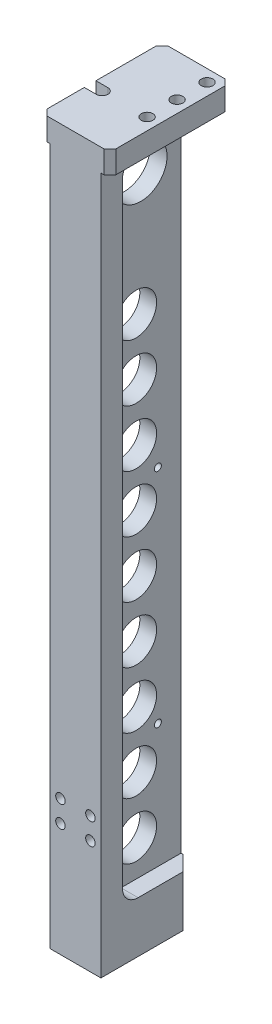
ISO-10303-21;
HEADER;
FILE_DESCRIPTION(('STEP AP214'),'2;1');
FILE_NAME('part.step','',(''),(''),'','','');
FILE_SCHEMA(('AUTOMOTIVE_DESIGN { 1 0 10303 214 1 1 1 1 }'));
ENDSEC;
DATA;
#1=APPLICATION_CONTEXT('core data for automotive mechanical design processes');
#2=APPLICATION_PROTOCOL_DEFINITION('international standard','automotive_design',2000,#1);
#3=PRODUCT_CONTEXT('',#1,'mechanical');
#4=PRODUCT('Part','Part','',(#3));
#5=PRODUCT_RELATED_PRODUCT_CATEGORY('part','',(#4));
#6=PRODUCT_DEFINITION_FORMATION('','',#4);
#7=PRODUCT_DEFINITION_CONTEXT('part definition',#1,'design');
#8=PRODUCT_DEFINITION('design','',#6,#7);
#9=PRODUCT_DEFINITION_SHAPE('','',#8);
#10=(LENGTH_UNIT() NAMED_UNIT(*) SI_UNIT(.MILLI.,.METRE.));
#11=(NAMED_UNIT(*) PLANE_ANGLE_UNIT() SI_UNIT($,.RADIAN.));
#12=(NAMED_UNIT(*) SI_UNIT($,.STERADIAN.) SOLID_ANGLE_UNIT());
#13=UNCERTAINTY_MEASURE_WITH_UNIT(LENGTH_MEASURE(1.E-05),#10,'distance_accuracy_value','');
#14=(GEOMETRIC_REPRESENTATION_CONTEXT(3) GLOBAL_UNCERTAINTY_ASSIGNED_CONTEXT((#13)) GLOBAL_UNIT_ASSIGNED_CONTEXT((#10,
#11,#12)) REPRESENTATION_CONTEXT('',''));
#15=CARTESIAN_POINT('',(0.,0.,0.));
#16=DIRECTION('',(0.,0.,1.));
#17=DIRECTION('',(1.,0.,0.));
#18=AXIS2_PLACEMENT_3D('',#15,#16,#17);
#19=CARTESIAN_POINT('',(-14.605,236.234886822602,0.));
#20=DIRECTION('',(-1.,0.,0.));
#21=DIRECTION('',(0.,0.,1.));
#22=AXIS2_PLACEMENT_3D('',#19,#20,#21);
#23=PLANE('',#22);
#24=DIRECTION('',(0.,1.,0.));
#25=VECTOR('',#24,1.);
#26=CARTESIAN_POINT('',(-14.605,288.206574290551,-23.28545));
#27=LINE('',#26,#25);
#28=CARTESIAN_POINT('',(-14.605,295.275,-23.28545));
#29=VERTEX_POINT('',#28);
#30=CARTESIAN_POINT('',(-14.605,304.8,-23.28545));
#31=VERTEX_POINT('',#30);
#32=EDGE_CURVE('E603',#29,#31,#27,.T.);
#33=ORIENTED_EDGE('',*,*,#32,.T.);
#34=DIRECTION('',(0.,0.,1.));
#35=VECTOR('',#34,1.);
#36=CARTESIAN_POINT('',(-14.605,304.8,0.));
#37=LINE('',#36,#35);
#38=CARTESIAN_POINT('',(-14.605,304.8,-48.768));
#39=VERTEX_POINT('',#38);
#40=EDGE_CURVE('E312',#39,#31,#37,.T.);
#41=ORIENTED_EDGE('',*,*,#40,.F.);
#42=DIRECTION('',(0.,-1.,0.));
#43=VECTOR('',#42,1.);
#44=CARTESIAN_POINT('',(-14.605,236.234886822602,-48.768));
#45=LINE('',#44,#43);
#46=CARTESIAN_POINT('',(-14.605,295.275,-48.768));
#47=VERTEX_POINT('',#46);
#48=EDGE_CURVE('E443',#39,#47,#45,.T.);
#49=ORIENTED_EDGE('',*,*,#48,.T.);
#50=DIRECTION('',(0.,0.,-1.));
#51=VECTOR('',#50,1.);
#52=CARTESIAN_POINT('',(-14.605,295.275,0.));
#53=LINE('',#52,#51);
#54=EDGE_CURVE('E316',#29,#47,#53,.T.);
#55=ORIENTED_EDGE('',*,*,#54,.F.);
#56=EDGE_LOOP('',(#33,#41,#49,#55));
#57=FACE_BOUND('',#56,.T.);
#58=ADVANCED_FACE('F44',(#57),#23,.T.);
#59=CARTESIAN_POINT('',(-3.556,21.59,-41.1479999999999));
#60=DIRECTION('',(-1.,0.,0.));
#61=DIRECTION('',(0.,0.,1.));
#62=AXIS2_PLACEMENT_3D('',#59,#60,#61);
#63=PLANE('',#62);
#64=CARTESIAN_POINT('',(-3.556,280.289,-24.13));
#65=DIRECTION('',(-1.,0.,0.));
#66=DIRECTION('',(0.,0.,1.));
#67=AXIS2_PLACEMENT_3D('',#64,#65,#66);
#68=CIRCLE('',#67,11.1125);
#69=CARTESIAN_POINT('',(-3.556,280.289,-13.0175));
#70=VERTEX_POINT('',#69);
#71=EDGE_CURVE('E568',#70,#70,#68,.T.);
#72=ORIENTED_EDGE('',*,*,#71,.F.);
#73=EDGE_LOOP('',(#72));
#74=FACE_BOUND('',#73,.T.);
#75=DIRECTION('',(0.,0.,-1.));
#76=VECTOR('',#75,1.);
#77=CARTESIAN_POINT('',(-3.556,258.699,-24.453379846));
#78=LINE('',#77,#76);
#79=CARTESIAN_POINT('',(-3.556,258.699,-31.057379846));
#80=VERTEX_POINT('',#79);
#81=CARTESIAN_POINT('',(-3.556,258.699,-41.148));
#82=VERTEX_POINT('',#81);
#83=EDGE_CURVE('E665',#80,#82,#78,.T.);
#84=ORIENTED_EDGE('',*,*,#83,.F.);
#85=CARTESIAN_POINT('',(-3.556,265.303,-31.057379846));
#86=DIRECTION('',(-1.,0.,0.));
#87=DIRECTION('',(0.,0.,1.));
#88=AXIS2_PLACEMENT_3D('',#85,#86,#87);
#89=CIRCLE('',#88,6.604);
#90=CARTESIAN_POINT('',(-3.556,265.303,-24.453379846));
#91=VERTEX_POINT('',#90);
#92=EDGE_CURVE('E491',#80,#91,#89,.T.);
#93=ORIENTED_EDGE('',*,*,#92,.T.);
#94=DIRECTION('',(0.,0.,-1.));
#95=VECTOR('',#94,1.);
#96=CARTESIAN_POINT('',(-3.556,265.303,-9.14399999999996));
#97=LINE('',#96,#95);
#98=CARTESIAN_POINT('',(-3.556,265.303,-15.748));
#99=VERTEX_POINT('',#98);
#100=EDGE_CURVE('E678',#99,#91,#97,.T.);
#101=ORIENTED_EDGE('',*,*,#100,.F.);
#102=CARTESIAN_POINT('',(-3.556,271.907,-15.748));
#103=DIRECTION('',(-1.,0.,0.));
#104=DIRECTION('',(0.,0.,1.));
#105=AXIS2_PLACEMENT_3D('',#102,#103,#104);
#106=CIRCLE('',#105,6.604);
#107=CARTESIAN_POINT('',(-3.556,271.907,-9.144));
#108=VERTEX_POINT('',#107);
#109=EDGE_CURVE('E489',#99,#108,#106,.T.);
#110=ORIENTED_EDGE('',*,*,#109,.T.);
#111=DIRECTION('',(0.,1.,0.));
#112=VECTOR('',#111,1.);
#113=CARTESIAN_POINT('',(-3.556,295.275,-9.144));
#114=LINE('',#113,#112);
#115=CARTESIAN_POINT('',(-3.556,288.671,-9.144));
#116=VERTEX_POINT('',#115);
#117=EDGE_CURVE('E364',#108,#116,#114,.T.);
#118=ORIENTED_EDGE('',*,*,#117,.T.);
#119=CARTESIAN_POINT('',(-3.556,288.671,-15.748));
#120=DIRECTION('',(-1.,0.,0.));
#121=DIRECTION('',(0.,0.,1.));
#122=AXIS2_PLACEMENT_3D('',#119,#120,#121);
#123=CIRCLE('',#122,6.604);
#124=CARTESIAN_POINT('',(-3.556,295.275,-15.748));
#125=VERTEX_POINT('',#124);
#126=EDGE_CURVE('E467',#116,#125,#123,.T.);
#127=ORIENTED_EDGE('',*,*,#126,.T.);
#128=DIRECTION('',(0.,0.,-1.));
#129=VECTOR('',#128,1.);
#130=CARTESIAN_POINT('',(-3.556,295.275,-41.148));
#131=LINE('',#130,#129);
#132=CARTESIAN_POINT('',(-3.556,295.275,-41.148));
#133=VERTEX_POINT('',#132);
#134=EDGE_CURVE('E368',#125,#133,#131,.T.);
#135=ORIENTED_EDGE('',*,*,#134,.T.);
#136=DIRECTION('',(0.,1.,0.));
#137=VECTOR('',#136,1.);
#138=CARTESIAN_POINT('',(-3.556,238.076104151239,-41.148));
#139=LINE('',#138,#137);
#140=EDGE_CURVE('E675',#82,#133,#139,.T.);
#141=ORIENTED_EDGE('',*,*,#140,.F.);
#142=EDGE_LOOP('',(#84,#93,#101,#110,#118,#127,#135,#141));
#143=FACE_BOUND('',#142,.T.);
#144=ADVANCED_FACE('F758',(#74,#143),#63,.T.);
#145=CARTESIAN_POINT('',(-3.556,228.854,-22.098));
#146=DIRECTION('',(-1.,0.,0.));
#147=DIRECTION('',(0.,0.,1.));
#148=AXIS2_PLACEMENT_3D('',#145,#146,#147);
#149=CIRCLE('',#148,8.73125);
#150=CARTESIAN_POINT('',(-3.556,228.854,-13.36675));
#151=VERTEX_POINT('',#150);
#152=EDGE_CURVE('E565',#151,#151,#149,.T.);
#153=ORIENTED_EDGE('',*,*,#152,.F.);
#154=EDGE_LOOP('',(#153));
#155=FACE_BOUND('',#154,.T.);
#156=CARTESIAN_POINT('',(-3.556,204.851,-22.098));
#157=DIRECTION('',(-1.,0.,0.));
#158=DIRECTION('',(0.,0.,1.));
#159=AXIS2_PLACEMENT_3D('',#156,#157,#158);
#160=CIRCLE('',#159,8.73125);
#161=CARTESIAN_POINT('',(-3.556,204.851,-13.36675));
#162=VERTEX_POINT('',#161);
#163=EDGE_CURVE('E562',#162,#162,#160,.T.);
#164=ORIENTED_EDGE('',*,*,#163,.F.);
#165=EDGE_LOOP('',(#164));
#166=FACE_BOUND('',#165,.T.);
#167=CARTESIAN_POINT('',(-3.556,180.848,-22.098));
#168=DIRECTION('',(-1.,0.,0.));
#169=DIRECTION('',(0.,0.,1.));
#170=AXIS2_PLACEMENT_3D('',#167,#168,#169);
#171=CIRCLE('',#170,8.73125);
#172=CARTESIAN_POINT('',(-3.556,180.848,-13.36675));
#173=VERTEX_POINT('',#172);
#174=EDGE_CURVE('E558',#173,#173,#171,.T.);
#175=ORIENTED_EDGE('',*,*,#174,.F.);
#176=EDGE_LOOP('',(#175));
#177=FACE_BOUND('',#176,.T.);
#178=CARTESIAN_POINT('',(-3.556,156.845,-22.098));
#179=DIRECTION('',(-1.,0.,0.));
#180=DIRECTION('',(0.,0.,1.));
#181=AXIS2_PLACEMENT_3D('',#178,#179,#180);
#182=CIRCLE('',#181,8.73125);
#183=CARTESIAN_POINT('',(-3.556,156.845,-13.36675));
#184=VERTEX_POINT('',#183);
#185=EDGE_CURVE('E554',#184,#184,#182,.T.);
#186=ORIENTED_EDGE('',*,*,#185,.F.);
#187=EDGE_LOOP('',(#186));
#188=FACE_BOUND('',#187,.T.);
#189=CARTESIAN_POINT('',(-3.556,132.842,-22.098));
#190=DIRECTION('',(-1.,0.,0.));
#191=DIRECTION('',(0.,0.,1.));
#192=AXIS2_PLACEMENT_3D('',#189,#190,#191);
#193=CIRCLE('',#192,8.73125);
#194=CARTESIAN_POINT('',(-3.556,132.842,-13.36675));
#195=VERTEX_POINT('',#194);
#196=EDGE_CURVE('E550',#195,#195,#193,.T.);
#197=ORIENTED_EDGE('',*,*,#196,.F.);
#198=EDGE_LOOP('',(#197));
#199=FACE_BOUND('',#198,.T.);
#200=CARTESIAN_POINT('',(-3.556,108.839,-22.098));
#201=DIRECTION('',(-1.,0.,0.));
#202=DIRECTION('',(0.,0.,1.));
#203=AXIS2_PLACEMENT_3D('',#200,#201,#202);
#204=CIRCLE('',#203,8.73124999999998);
#205=CARTESIAN_POINT('',(-3.556,108.839,-13.36675));
#206=VERTEX_POINT('',#205);
#207=EDGE_CURVE('E546',#206,#206,#204,.T.);
#208=ORIENTED_EDGE('',*,*,#207,.F.);
#209=EDGE_LOOP('',(#208));
#210=FACE_BOUND('',#209,.T.);
#211=CARTESIAN_POINT('',(-3.556,84.836,-22.098));
#212=DIRECTION('',(-1.,0.,0.));
#213=DIRECTION('',(0.,0.,1.));
#214=AXIS2_PLACEMENT_3D('',#211,#212,#213);
#215=CIRCLE('',#214,8.73124999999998);
#216=CARTESIAN_POINT('',(-3.556,84.836,-13.36675));
#217=VERTEX_POINT('',#216);
#218=EDGE_CURVE('E542',#217,#217,#215,.T.);
#219=ORIENTED_EDGE('',*,*,#218,.F.);
#220=EDGE_LOOP('',(#219));
#221=FACE_BOUND('',#220,.T.);
#222=CARTESIAN_POINT('',(-3.556,60.833,-22.098));
#223=DIRECTION('',(-1.,0.,0.));
#224=DIRECTION('',(0.,0.,1.));
#225=AXIS2_PLACEMENT_3D('',#222,#223,#224);
#226=CIRCLE('',#225,8.73124999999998);
#227=CARTESIAN_POINT('',(-3.556,60.833,-13.36675));
#228=VERTEX_POINT('',#227);
#229=EDGE_CURVE('E538',#228,#228,#226,.T.);
#230=ORIENTED_EDGE('',*,*,#229,.F.);
#231=EDGE_LOOP('',(#230));
#232=FACE_BOUND('',#231,.T.);
#233=CARTESIAN_POINT('',(-3.556,36.83,-22.098));
#234=DIRECTION('',(-1.,0.,0.));
#235=DIRECTION('',(0.,0.,1.));
#236=AXIS2_PLACEMENT_3D('',#233,#234,#235);
#237=CIRCLE('',#236,8.73124999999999);
#238=CARTESIAN_POINT('',(-3.556,36.83,-13.36675));
#239=VERTEX_POINT('',#238);
#240=EDGE_CURVE('E534',#239,#239,#237,.T.);
#241=ORIENTED_EDGE('',*,*,#240,.F.);
#242=EDGE_LOOP('',(#241));
#243=FACE_BOUND('',#242,.T.);
#244=CARTESIAN_POINT('',(-3.556,168.021,-31.3690000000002));
#245=DIRECTION('',(-1.,0.,0.));
#246=DIRECTION('',(0.,0.,1.));
#247=AXIS2_PLACEMENT_3D('',#244,#245,#246);
#248=CIRCLE('',#247,1.47319999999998);
#249=CARTESIAN_POINT('',(-3.556,168.021,-29.8958000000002));
#250=VERTEX_POINT('',#249);
#251=EDGE_CURVE('E530',#250,#250,#248,.T.);
#252=ORIENTED_EDGE('',*,*,#251,.F.);
#253=EDGE_LOOP('',(#252));
#254=FACE_BOUND('',#253,.T.);
#255=CARTESIAN_POINT('',(-3.556,74.0410000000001,-31.3690000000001));
#256=DIRECTION('',(-1.,0.,0.));
#257=DIRECTION('',(0.,0.,1.));
#258=AXIS2_PLACEMENT_3D('',#255,#256,#257);
#259=CIRCLE('',#258,1.47319999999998);
#260=CARTESIAN_POINT('',(-3.556,74.0410000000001,-29.8958000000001));
#261=VERTEX_POINT('',#260);
#262=EDGE_CURVE('E526',#261,#261,#259,.T.);
#263=ORIENTED_EDGE('',*,*,#262,.F.);
#264=EDGE_LOOP('',(#263));
#265=FACE_BOUND('',#264,.T.);
#266=CARTESIAN_POINT('',(-3.556,28.194,-9.14399999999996));
#267=VERTEX_POINT('',#266);
#268=CARTESIAN_POINT('',(-3.556,237.49,-9.14399999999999));
#269=VERTEX_POINT('',#268);
#270=EDGE_CURVE('E365',#267,#269,#114,.T.);
#271=ORIENTED_EDGE('',*,*,#270,.T.);
#272=CARTESIAN_POINT('',(-3.556,237.49,-15.748));
#273=DIRECTION('',(-1.,0.,0.));
#274=DIRECTION('',(0.,0.,1.));
#275=AXIS2_PLACEMENT_3D('',#272,#273,#274);
#276=CIRCLE('',#275,6.604);
#277=CARTESIAN_POINT('',(-3.556,244.094,-15.748));
#278=VERTEX_POINT('',#277);
#279=EDGE_CURVE('E496',#269,#278,#276,.T.);
#280=ORIENTED_EDGE('',*,*,#279,.T.);
#281=DIRECTION('',(0.,0.,1.));
#282=VECTOR('',#281,1.);
#283=CARTESIAN_POINT('',(-3.556,244.094,-9.14399999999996));
#284=LINE('',#283,#282);
#285=CARTESIAN_POINT('',(-3.556,244.094,-36.0831414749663));
#286=VERTEX_POINT('',#285);
#287=EDGE_CURVE('E685',#286,#278,#284,.T.);
#288=ORIENTED_EDGE('',*,*,#287,.F.);
#289=DIRECTION('',(0.,-1.,0.));
#290=VECTOR('',#289,1.);
#291=CARTESIAN_POINT('',(-3.556,0.,-36.0831414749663));
#292=LINE('',#291,#290);
#293=CARTESIAN_POINT('',(-3.556,21.59,-36.0831414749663));
#294=VERTEX_POINT('',#293);
#295=EDGE_CURVE('E371',#286,#294,#292,.T.);
#296=ORIENTED_EDGE('',*,*,#295,.T.);
#297=DIRECTION('',(0.,0.,1.));
#298=VECTOR('',#297,1.);
#299=CARTESIAN_POINT('',(-3.556,21.59,-41.1479999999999));
#300=LINE('',#299,#298);
#301=CARTESIAN_POINT('',(-3.556,21.59,-15.748));
#302=VERTEX_POINT('',#301);
#303=EDGE_CURVE('E361',#294,#302,#300,.T.);
#304=ORIENTED_EDGE('',*,*,#303,.T.);
#305=CARTESIAN_POINT('',(-3.556,28.194,-15.748));
#306=DIRECTION('',(-1.,0.,0.));
#307=DIRECTION('',(0.,0.,1.));
#308=AXIS2_PLACEMENT_3D('',#305,#306,#307);
#309=CIRCLE('',#308,6.604);
#310=EDGE_CURVE('E469',#302,#267,#309,.T.);
#311=ORIENTED_EDGE('',*,*,#310,.T.);
#312=EDGE_LOOP('',(#271,#280,#288,#296,#304,#311));
#313=FACE_BOUND('',#312,.T.);
#314=ADVANCED_FACE('F804',(#155,#166,#177,#188,#199,#210,#221,#232,#243,#254,#265,#313),#63,.T.);
#315=CARTESIAN_POINT('',(-10.7949999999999,0.,-24.8016352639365));
#316=DIRECTION('',(0.841632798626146,0.,0.540050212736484));
#317=DIRECTION('',(0.540050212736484,0.,-0.841632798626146));
#318=AXIS2_PLACEMENT_3D('',#315,#316,#317);
#319=PLANE('',#318);
#320=DIRECTION('',(0.54005021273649,0.,-0.841632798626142));
#321=VECTOR('',#320,1.);
#322=CARTESIAN_POINT('',(-3.556,244.094,-36.0831414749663));
#323=LINE('',#322,#321);
#324=CARTESIAN_POINT('',(-0.306034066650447,244.094,-41.148));
#325=VERTEX_POINT('',#324);
#326=EDGE_CURVE('E676',#286,#325,#323,.T.);
#327=ORIENTED_EDGE('',*,*,#326,.T.);
#328=DIRECTION('',(0.,1.,0.));
#329=VECTOR('',#328,1.);
#330=CARTESIAN_POINT('',(-0.306034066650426,0.,-41.148));
#331=LINE('',#330,#329);
#332=CARTESIAN_POINT('',(-0.306034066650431,0.,-41.148));
#333=VERTEX_POINT('',#332);
#334=EDGE_CURVE('E387',#333,#325,#331,.T.);
#335=ORIENTED_EDGE('',*,*,#334,.F.);
#336=DIRECTION('',(0.540050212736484,0.,-0.841632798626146));
#337=VECTOR('',#336,1.);
#338=CARTESIAN_POINT('',(-10.7949999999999,0.,-24.8016352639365));
#339=LINE('',#338,#337);
#340=CARTESIAN_POINT('',(-10.7949999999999,0.,-24.8016352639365));
#341=VERTEX_POINT('',#340);
#342=EDGE_CURVE('E382',#341,#333,#339,.T.);
#343=ORIENTED_EDGE('',*,*,#342,.F.);
#344=DIRECTION('',(0.,1.,0.));
#345=VECTOR('',#344,1.);
#346=CARTESIAN_POINT('',(-10.7949999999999,0.,-24.8016352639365));
#347=LINE('',#346,#345);
#348=CARTESIAN_POINT('',(-10.795,21.59,-24.8016352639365));
#349=VERTEX_POINT('',#348);
#350=EDGE_CURVE('E386',#341,#349,#347,.T.);
#351=ORIENTED_EDGE('',*,*,#350,.T.);
#352=DIRECTION('',(0.540050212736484,0.,-0.841632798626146));
#353=VECTOR('',#352,1.);
#354=CARTESIAN_POINT('',(-10.795,21.59,-24.8016352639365));
#355=LINE('',#354,#353);
#356=EDGE_CURVE('E373',#349,#294,#355,.T.);
#357=ORIENTED_EDGE('',*,*,#356,.T.);
#358=ORIENTED_EDGE('',*,*,#295,.F.);
#359=EDGE_LOOP('',(#327,#335,#343,#351,#357,#358));
#360=FACE_BOUND('',#359,.T.);
#361=ADVANCED_FACE('F840',(#360),#319,.F.);
#362=CARTESIAN_POINT('',(10.795,295.275,-41.148));
#363=DIRECTION('',(0.,1.,0.));
#364=DIRECTION('',(0.,0.,1.));
#365=AXIS2_PLACEMENT_3D('',#362,#363,#364);
#366=PLANE('',#365);
#367=CARTESIAN_POINT('',(9.525,295.275,-20.828));
#368=DIRECTION('',(0.,1.,0.));
#369=DIRECTION('',(0.,0.,1.));
#370=AXIS2_PLACEMENT_3D('',#367,#368,#369);
#371=CIRCLE('',#370,2.45744999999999);
#372=CARTESIAN_POINT('',(9.525,295.275,-18.37055));
#373=VERTEX_POINT('',#372);
#374=EDGE_CURVE('E619',#373,#373,#371,.T.);
#375=ORIENTED_EDGE('',*,*,#374,.T.);
#376=EDGE_LOOP('',(#375));
#377=FACE_BOUND('',#376,.T.);
#378=CARTESIAN_POINT('',(9.525,295.275,-33.528));
#379=DIRECTION('',(0.,1.,0.));
#380=DIRECTION('',(0.,0.,1.));
#381=AXIS2_PLACEMENT_3D('',#378,#379,#380);
#382=CIRCLE('',#381,2.45744999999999);
#383=CARTESIAN_POINT('',(9.525,295.275,-31.07055));
#384=VERTEX_POINT('',#383);
#385=EDGE_CURVE('E625',#384,#384,#382,.T.);
#386=ORIENTED_EDGE('',*,*,#385,.T.);
#387=EDGE_LOOP('',(#386));
#388=FACE_BOUND('',#387,.T.);
#389=CARTESIAN_POINT('',(9.525,295.275,-46.228));
#390=DIRECTION('',(0.,1.,0.));
#391=DIRECTION('',(0.,0.,1.));
#392=AXIS2_PLACEMENT_3D('',#389,#390,#391);
#393=CIRCLE('',#392,2.45744999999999);
#394=CARTESIAN_POINT('',(9.525,295.275,-43.77055));
#395=VERTEX_POINT('',#394);
#396=EDGE_CURVE('E519',#395,#395,#393,.T.);
#397=ORIENTED_EDGE('',*,*,#396,.T.);
#398=EDGE_LOOP('',(#397));
#399=FACE_BOUND('',#398,.T.);
#400=CARTESIAN_POINT('',(-9.525,295.275,-20.828));
#401=DIRECTION('',(0.,1.,0.));
#402=DIRECTION('',(0.,0.,1.));
#403=AXIS2_PLACEMENT_3D('',#400,#401,#402);
#404=CIRCLE('',#403,2.45744999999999);
#405=CARTESIAN_POINT('',(-9.525,295.275,-18.37055));
#406=VERTEX_POINT('',#405);
#407=CARTESIAN_POINT('',(-9.52499999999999,295.275,-23.28545));
#408=VERTEX_POINT('',#407);
#409=EDGE_CURVE('E613',#406,#408,#404,.T.);
#410=ORIENTED_EDGE('',*,*,#409,.T.);
#411=DIRECTION('',(1.,0.,0.));
#412=VECTOR('',#411,1.);
#413=CARTESIAN_POINT('',(-14.605,295.275,-23.28545));
#414=LINE('',#413,#412);
#415=EDGE_CURVE('E61',#29,#408,#414,.T.);
#416=ORIENTED_EDGE('',*,*,#415,.F.);
#417=ORIENTED_EDGE('',*,*,#54,.T.);
#418=DIRECTION('',(-0.707106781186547,0.,0.707106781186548));
#419=VECTOR('',#418,1.);
#420=CARTESIAN_POINT('',(-12.065,295.275,-51.308));
#421=LINE('',#420,#419);
#422=CARTESIAN_POINT('',(-12.065,295.275,-51.308));
#423=VERTEX_POINT('',#422);
#424=EDGE_CURVE('E430',#47,#423,#421,.F.);
#425=ORIENTED_EDGE('',*,*,#424,.T.);
#426=DIRECTION('',(1.,0.,0.));
#427=VECTOR('',#426,1.);
#428=CARTESIAN_POINT('',(14.605,295.275,-51.308));
#429=LINE('',#428,#427);
#430=CARTESIAN_POINT('',(12.065,295.275,-51.308));
#431=VERTEX_POINT('',#430);
#432=EDGE_CURVE('E322',#423,#431,#429,.T.);
#433=ORIENTED_EDGE('',*,*,#432,.T.);
#434=DIRECTION('',(-0.707106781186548,0.,-0.707106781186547));
#435=VECTOR('',#434,1.);
#436=CARTESIAN_POINT('',(14.605,295.275,-48.768));
#437=LINE('',#436,#435);
#438=CARTESIAN_POINT('',(14.605,295.275,-48.7680000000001));
#439=VERTEX_POINT('',#438);
#440=EDGE_CURVE('E436',#431,#439,#437,.F.);
#441=ORIENTED_EDGE('',*,*,#440,.T.);
#442=DIRECTION('',(0.,0.,1.));
#443=VECTOR('',#442,1.);
#444=CARTESIAN_POINT('',(14.605,295.275,0.));
#445=LINE('',#444,#443);
#446=CARTESIAN_POINT('',(14.605,295.275,-2.54000000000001));
#447=VERTEX_POINT('',#446);
#448=EDGE_CURVE('E326',#439,#447,#445,.T.);
#449=ORIENTED_EDGE('',*,*,#448,.T.);
#450=DIRECTION('',(-0.707106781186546,0.,0.707106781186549));
#451=VECTOR('',#450,1.);
#452=CARTESIAN_POINT('',(12.065,295.275,0.));
#453=LINE('',#452,#451);
#454=CARTESIAN_POINT('',(12.065,295.275,0.));
#455=VERTEX_POINT('',#454);
#456=EDGE_CURVE('E434',#447,#455,#453,.T.);
#457=ORIENTED_EDGE('',*,*,#456,.T.);
#458=DIRECTION('',(-1.,0.,0.));
#459=VECTOR('',#458,1.);
#460=CARTESIAN_POINT('',(14.605,295.275,0.));
#461=LINE('',#460,#459);
#462=CARTESIAN_POINT('',(10.795,295.275,0.));
#463=VERTEX_POINT('',#462);
#464=EDGE_CURVE('E699',#455,#463,#461,.T.);
#465=ORIENTED_EDGE('',*,*,#464,.T.);
#466=DIRECTION('',(0.,0.,-1.));
#467=VECTOR('',#466,1.);
#468=CARTESIAN_POINT('',(10.795,295.275,-41.148));
#469=LINE('',#468,#467);
#470=CARTESIAN_POINT('',(10.795,295.275,-15.748));
#471=VERTEX_POINT('',#470);
#472=EDGE_CURVE('E330',#463,#471,#469,.T.);
#473=ORIENTED_EDGE('',*,*,#472,.T.);
#474=DIRECTION('',(1.,0.,0.));
#475=VECTOR('',#474,1.);
#476=CARTESIAN_POINT('',(10.795,295.275,-15.748));
#477=LINE('',#476,#475);
#478=CARTESIAN_POINT('',(3.556,295.275,-15.748));
#479=VERTEX_POINT('',#478);
#480=EDGE_CURVE('E471',#471,#479,#477,.F.);
#481=ORIENTED_EDGE('',*,*,#480,.T.);
#482=DIRECTION('',(0.,0.,-1.));
#483=VECTOR('',#482,1.);
#484=CARTESIAN_POINT('',(3.556,295.275,-41.148));
#485=LINE('',#484,#483);
#486=CARTESIAN_POINT('',(3.556,295.275,-41.148));
#487=VERTEX_POINT('',#486);
#488=EDGE_CURVE('E343',#479,#487,#485,.T.);
#489=ORIENTED_EDGE('',*,*,#488,.T.);
#490=DIRECTION('',(-1.,0.,0.));
#491=VECTOR('',#490,1.);
#492=CARTESIAN_POINT('',(-10.795,295.275,-41.148));
#493=LINE('',#492,#491);
#494=EDGE_CURVE('E325',#487,#133,#493,.T.);
#495=ORIENTED_EDGE('',*,*,#494,.T.);
#496=ORIENTED_EDGE('',*,*,#134,.F.);
#497=DIRECTION('',(-1.,0.,0.));
#498=VECTOR('',#497,1.);
#499=CARTESIAN_POINT('',(-10.795,295.275,-15.748));
#500=LINE('',#499,#498);
#501=CARTESIAN_POINT('',(-10.795,295.275,-15.748));
#502=VERTEX_POINT('',#501);
#503=EDGE_CURVE('E473',#125,#502,#500,.T.);
#504=ORIENTED_EDGE('',*,*,#503,.T.);
#505=DIRECTION('',(0.,0.,1.));
#506=VECTOR('',#505,1.);
#507=CARTESIAN_POINT('',(-10.795,295.275,-41.148));
#508=LINE('',#507,#506);
#509=CARTESIAN_POINT('',(-10.795,295.275,0.));
#510=VERTEX_POINT('',#509);
#511=EDGE_CURVE('E329',#502,#510,#508,.T.);
#512=ORIENTED_EDGE('',*,*,#511,.T.);
#513=CARTESIAN_POINT('',(-12.065,295.275,0.));
#514=VERTEX_POINT('',#513);
#515=EDGE_CURVE('E698',#510,#514,#461,.T.);
#516=ORIENTED_EDGE('',*,*,#515,.T.);
#517=DIRECTION('',(-0.707106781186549,0.,-0.707106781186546));
#518=VECTOR('',#517,1.);
#519=CARTESIAN_POINT('',(-14.605,295.275,-2.53999999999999));
#520=LINE('',#519,#518);
#521=CARTESIAN_POINT('',(-14.605,295.275,-2.53999999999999));
#522=VERTEX_POINT('',#521);
#523=EDGE_CURVE('E432',#514,#522,#520,.T.);
#524=ORIENTED_EDGE('',*,*,#523,.T.);
#525=CARTESIAN_POINT('',(-14.605,295.275,-18.37055));
#526=VERTEX_POINT('',#525);
#527=EDGE_CURVE('E696',#522,#526,#53,.T.);
#528=ORIENTED_EDGE('',*,*,#527,.T.);
#529=DIRECTION('',(-1.,0.,0.));
#530=VECTOR('',#529,1.);
#531=CARTESIAN_POINT('',(-14.605,295.275,-18.37055));
#532=LINE('',#531,#530);
#533=EDGE_CURVE('E289',#406,#526,#532,.T.);
#534=ORIENTED_EDGE('',*,*,#533,.F.);
#535=EDGE_LOOP('',(#410,#416,#417,#425,#433,#441,#449,#457,#465,#473,#481,#489,#495,#496,#504,
#512,#516,#524,#528,#534));
#536=FACE_BOUND('',#535,.T.);
#537=ADVANCED_FACE('F716',(#377,#388,#399,#536),#366,.F.);
#538=CARTESIAN_POINT('',(-3.556,295.275,-9.144));
#539=DIRECTION('',(0.,0.,1.));
#540=DIRECTION('',(0.,-1.,0.));
#541=AXIS2_PLACEMENT_3D('',#538,#539,#540);
#542=PLANE('',#541);
#543=ORIENTED_EDGE('',*,*,#117,.F.);
#544=DIRECTION('',(1.,0.,0.));
#545=VECTOR('',#544,1.);
#546=CARTESIAN_POINT('',(-10.795,271.907,-9.144));
#547=LINE('',#546,#545);
#548=CARTESIAN_POINT('',(-10.795,271.907,-9.144));
#549=VERTEX_POINT('',#548);
#550=EDGE_CURVE('E503',#108,#549,#547,.F.);
#551=ORIENTED_EDGE('',*,*,#550,.T.);
#552=DIRECTION('',(0.,1.,0.));
#553=VECTOR('',#552,1.);
#554=CARTESIAN_POINT('',(-10.795,295.275,-9.144));
#555=LINE('',#554,#553);
#556=CARTESIAN_POINT('',(-10.795,288.671,-9.144));
#557=VERTEX_POINT('',#556);
#558=EDGE_CURVE('E357',#549,#557,#555,.T.);
#559=ORIENTED_EDGE('',*,*,#558,.T.);
#560=DIRECTION('',(-1.,0.,0.));
#561=VECTOR('',#560,1.);
#562=CARTESIAN_POINT('',(-3.556,288.671,-9.144));
#563=LINE('',#562,#561);
#564=EDGE_CURVE('E459',#557,#116,#563,.F.);
#565=ORIENTED_EDGE('',*,*,#564,.T.);
#566=EDGE_LOOP('',(#543,#551,#559,#565));
#567=FACE_BOUND('',#566,.T.);
#568=ADVANCED_FACE('F824',(#567),#542,.F.);
#569=CARTESIAN_POINT('',(-6.35000000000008,57.2770000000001,-9.14399999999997));
#570=DIRECTION('',(0.,0.,1.));
#571=DIRECTION('',(0.,-1.,0.));
#572=AXIS2_PLACEMENT_3D('',#569,#570,#571);
#573=CIRCLE('',#572,2.01929999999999);
#574=CARTESIAN_POINT('',(-6.35000000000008,55.2577000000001,-9.14399999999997));
#575=VERTEX_POINT('',#574);
#576=EDGE_CURVE('E1572',#575,#575,#573,.T.);
#577=ORIENTED_EDGE('',*,*,#576,.T.);
#578=EDGE_LOOP('',(#577));
#579=FACE_BOUND('',#578,.T.);
#580=CARTESIAN_POINT('',(-6.35000000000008,48.1330000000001,-9.14399999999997));
#581=DIRECTION('',(0.,0.,1.));
#582=DIRECTION('',(0.,-1.,0.));
#583=AXIS2_PLACEMENT_3D('',#580,#581,#582);
#584=CIRCLE('',#583,2.01929999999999);
#585=CARTESIAN_POINT('',(-6.35000000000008,46.1137000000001,-9.14399999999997));
#586=VERTEX_POINT('',#585);
#587=EDGE_CURVE('E574',#586,#586,#584,.T.);
#588=ORIENTED_EDGE('',*,*,#587,.T.);
#589=EDGE_LOOP('',(#588));
#590=FACE_BOUND('',#589,.T.);
#591=CARTESIAN_POINT('',(-10.795,28.194,-9.14399999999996));
#592=VERTEX_POINT('',#591);
#593=CARTESIAN_POINT('',(-10.795,237.49,-9.14399999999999));
#594=VERTEX_POINT('',#593);
#595=EDGE_CURVE('E358',#592,#594,#555,.T.);
#596=ORIENTED_EDGE('',*,*,#595,.T.);
#597=DIRECTION('',(1.,0.,0.));
#598=VECTOR('',#597,1.);
#599=CARTESIAN_POINT('',(-3.556,237.49,-9.14399999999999));
#600=LINE('',#599,#598);
#601=EDGE_CURVE('E493',#594,#269,#600,.T.);
#602=ORIENTED_EDGE('',*,*,#601,.T.);
#603=ORIENTED_EDGE('',*,*,#270,.F.);
#604=DIRECTION('',(-1.,0.,0.));
#605=VECTOR('',#604,1.);
#606=CARTESIAN_POINT('',(-10.795,28.194,-9.14399999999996));
#607=LINE('',#606,#605);
#608=EDGE_CURVE('E462',#267,#592,#607,.T.);
#609=ORIENTED_EDGE('',*,*,#608,.T.);
#610=EDGE_LOOP('',(#596,#602,#603,#609));
#611=FACE_BOUND('',#610,.T.);
#612=ADVANCED_FACE('F827',(#579,#590,#611),#542,.F.);
#613=CARTESIAN_POINT('',(10.795,304.8,-41.148));
#614=DIRECTION('',(-1.,0.,0.));
#615=DIRECTION('',(0.,0.,1.));
#616=AXIS2_PLACEMENT_3D('',#613,#614,#615);
#617=PLANE('',#616);
#618=ORIENTED_EDGE('',*,*,#472,.F.);
#619=DIRECTION('',(0.,-1.,0.));
#620=VECTOR('',#619,1.);
#621=CARTESIAN_POINT('',(10.795,304.8,0.));
#622=LINE('',#621,#620);
#623=CARTESIAN_POINT('',(10.795,0.,0.));
#624=VERTEX_POINT('',#623);
#625=EDGE_CURVE('E406',#463,#624,#622,.T.);
#626=ORIENTED_EDGE('',*,*,#625,.T.);
#627=DIRECTION('',(0.,0.,-1.));
#628=VECTOR('',#627,1.);
#629=CARTESIAN_POINT('',(10.795,0.,-41.148));
#630=LINE('',#629,#628);
#631=CARTESIAN_POINT('',(10.795,0.,-34.798));
#632=VERTEX_POINT('',#631);
#633=EDGE_CURVE('E398',#624,#632,#630,.T.);
#634=ORIENTED_EDGE('',*,*,#633,.T.);
#635=DIRECTION('',(0.,-1.,0.));
#636=VECTOR('',#635,1.);
#637=CARTESIAN_POINT('',(10.795,25.4,-34.798));
#638=LINE('',#637,#636);
#639=CARTESIAN_POINT('',(10.795,21.59,-34.798));
#640=VERTEX_POINT('',#639);
#641=EDGE_CURVE('E380',#640,#632,#638,.T.);
#642=ORIENTED_EDGE('',*,*,#641,.F.);
#643=DIRECTION('',(0.,0.,1.));
#644=VECTOR('',#643,1.);
#645=CARTESIAN_POINT('',(10.795,21.59,-41.1479999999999));
#646=LINE('',#645,#644);
#647=CARTESIAN_POINT('',(10.795,21.59,-15.748));
#648=VERTEX_POINT('',#647);
#649=EDGE_CURVE('E337',#640,#648,#646,.T.);
#650=ORIENTED_EDGE('',*,*,#649,.T.);
#651=CARTESIAN_POINT('',(10.795,28.194,-15.748));
#652=DIRECTION('',(-1.,0.,0.));
#653=DIRECTION('',(0.,0.,1.));
#654=AXIS2_PLACEMENT_3D('',#651,#652,#653);
#655=CIRCLE('',#654,6.604);
#656=CARTESIAN_POINT('',(10.795,28.194,-9.14399999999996));
#657=VERTEX_POINT('',#656);
#658=EDGE_CURVE('E476',#648,#657,#655,.T.);
#659=ORIENTED_EDGE('',*,*,#658,.T.);
#660=DIRECTION('',(0.,1.,0.));
#661=VECTOR('',#660,1.);
#662=CARTESIAN_POINT('',(10.795,295.275,-9.144));
#663=LINE('',#662,#661);
#664=CARTESIAN_POINT('',(10.795,288.671,-9.144));
#665=VERTEX_POINT('',#664);
#666=EDGE_CURVE('E332',#657,#665,#663,.T.);
#667=ORIENTED_EDGE('',*,*,#666,.T.);
#668=CARTESIAN_POINT('',(10.795,288.671,-15.748));
#669=DIRECTION('',(-1.,0.,0.));
#670=DIRECTION('',(0.,0.,1.));
#671=AXIS2_PLACEMENT_3D('',#668,#669,#670);
#672=CIRCLE('',#671,6.604);
#673=EDGE_CURVE('E483',#665,#471,#672,.T.);
#674=ORIENTED_EDGE('',*,*,#673,.T.);
#675=EDGE_LOOP('',(#618,#626,#634,#642,#650,#659,#667,#674));
#676=FACE_BOUND('',#675,.T.);
#677=ADVANCED_FACE('F725',(#676),#617,.F.);
#678=CARTESIAN_POINT('',(-10.795,304.8,-41.148));
#679=DIRECTION('',(0.,0.,1.));
#680=DIRECTION('',(1.,0.,0.));
#681=AXIS2_PLACEMENT_3D('',#678,#679,#680);
#682=PLANE('',#681);
#683=ORIENTED_EDGE('',*,*,#494,.F.);
#684=DIRECTION('',(0.,-1.,0.));
#685=VECTOR('',#684,1.);
#686=CARTESIAN_POINT('',(3.556,295.275,-41.148));
#687=LINE('',#686,#685);
#688=CARTESIAN_POINT('',(3.556,21.59,-41.1479999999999));
#689=VERTEX_POINT('',#688);
#690=EDGE_CURVE('E340',#487,#689,#687,.T.);
#691=ORIENTED_EDGE('',*,*,#690,.T.);
#692=DIRECTION('',(1.,0.,0.));
#693=VECTOR('',#692,1.);
#694=CARTESIAN_POINT('',(3.556,21.59,-41.1479999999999));
#695=LINE('',#694,#693);
#696=CARTESIAN_POINT('',(4.44500000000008,21.59,-41.1479999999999));
#697=VERTEX_POINT('',#696);
#698=EDGE_CURVE('E351',#689,#697,#695,.T.);
#699=ORIENTED_EDGE('',*,*,#698,.T.);
#700=DIRECTION('',(0.,-1.,0.));
#701=VECTOR('',#700,1.);
#702=CARTESIAN_POINT('',(4.445,25.4,-41.148));
#703=LINE('',#702,#701);
#704=CARTESIAN_POINT('',(4.445,0.,-41.148));
#705=VERTEX_POINT('',#704);
#706=EDGE_CURVE('E379',#697,#705,#703,.T.);
#707=ORIENTED_EDGE('',*,*,#706,.T.);
#708=DIRECTION('',(-1.,0.,0.));
#709=VECTOR('',#708,1.);
#710=CARTESIAN_POINT('',(-10.795,0.,-41.148));
#711=LINE('',#710,#709);
#712=EDGE_CURVE('E401',#705,#333,#711,.T.);
#713=ORIENTED_EDGE('',*,*,#712,.T.);
#714=ORIENTED_EDGE('',*,*,#334,.T.);
#715=DIRECTION('',(-1.,0.,0.));
#716=VECTOR('',#715,1.);
#717=CARTESIAN_POINT('',(-0.306034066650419,244.094,-41.1479999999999));
#718=LINE('',#717,#716);
#719=CARTESIAN_POINT('',(-10.795,244.094,-41.148));
#720=VERTEX_POINT('',#719);
#721=EDGE_CURVE('E679',#325,#720,#718,.T.);
#722=ORIENTED_EDGE('',*,*,#721,.T.);
#723=DIRECTION('',(0.,-1.,0.));
#724=VECTOR('',#723,1.);
#725=CARTESIAN_POINT('',(-10.795,244.094,-41.148));
#726=LINE('',#725,#724);
#727=CARTESIAN_POINT('',(-10.795,258.699,-41.148));
#728=VERTEX_POINT('',#727);
#729=EDGE_CURVE('E669',#728,#720,#726,.T.);
#730=ORIENTED_EDGE('',*,*,#729,.F.);
#731=DIRECTION('',(1.,0.,0.));
#732=VECTOR('',#731,1.);
#733=CARTESIAN_POINT('',(-10.795,258.699,-41.148));
#734=LINE('',#733,#732);
#735=EDGE_CURVE('E672',#728,#82,#734,.T.);
#736=ORIENTED_EDGE('',*,*,#735,.T.);
#737=ORIENTED_EDGE('',*,*,#140,.T.);
#738=EDGE_LOOP('',(#683,#691,#699,#707,#713,#714,#722,#730,#736,#737));
#739=FACE_BOUND('',#738,.T.);
#740=ADVANCED_FACE('F752',(#739),#682,.F.);
#741=CARTESIAN_POINT('',(-10.795,304.8,-41.148));
#742=DIRECTION('',(1.,0.,0.));
#743=DIRECTION('',(0.,0.,-1.));
#744=AXIS2_PLACEMENT_3D('',#741,#742,#743);
#745=PLANE('',#744);
#746=CARTESIAN_POINT('',(-10.795,251.3965,-36.576));
#747=DIRECTION('',(-1.,0.,0.));
#748=DIRECTION('',(0.,0.,1.));
#749=AXIS2_PLACEMENT_3D('',#746,#747,#748);
#750=CIRCLE('',#749,1.72719999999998);
#751=CARTESIAN_POINT('',(-10.795,251.3965,-34.8488));
#752=VERTEX_POINT('',#751);
#753=EDGE_CURVE('E522',#752,#752,#750,.T.);
#754=ORIENTED_EDGE('',*,*,#753,.F.);
#755=EDGE_LOOP('',(#754));
#756=FACE_BOUND('',#755,.T.);
#757=CARTESIAN_POINT('',(-10.795,260.731,-18.542));
#758=DIRECTION('',(-1.,0.,0.));
#759=DIRECTION('',(0.,0.,1.));
#760=AXIS2_PLACEMENT_3D('',#757,#758,#759);
#761=CIRCLE('',#760,1.72719999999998);
#762=CARTESIAN_POINT('',(-10.795,260.731,-16.8148));
#763=VERTEX_POINT('',#762);
#764=EDGE_CURVE('E635',#763,#763,#761,.T.);
#765=ORIENTED_EDGE('',*,*,#764,.F.);
#766=EDGE_LOOP('',(#765));
#767=FACE_BOUND('',#766,.T.);
#768=CARTESIAN_POINT('',(-10.795,251.3965,-18.542));
#769=DIRECTION('',(-1.,0.,0.));
#770=DIRECTION('',(0.,0.,1.));
#771=AXIS2_PLACEMENT_3D('',#768,#769,#770);
#772=CIRCLE('',#771,1.72719999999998);
#773=CARTESIAN_POINT('',(-10.795,251.3965,-16.8148));
#774=VERTEX_POINT('',#773);
#775=EDGE_CURVE('E641',#774,#774,#772,.T.);
#776=ORIENTED_EDGE('',*,*,#775,.F.);
#777=EDGE_LOOP('',(#776));
#778=FACE_BOUND('',#777,.T.);
#779=ORIENTED_EDGE('',*,*,#511,.F.);
#780=CARTESIAN_POINT('',(-10.795,288.671,-15.748));
#781=DIRECTION('',(1.,0.,0.));
#782=DIRECTION('',(0.,0.,-1.));
#783=AXIS2_PLACEMENT_3D('',#780,#781,#782);
#784=CIRCLE('',#783,6.604);
#785=EDGE_CURVE('E480',#502,#557,#784,.T.);
#786=ORIENTED_EDGE('',*,*,#785,.T.);
#787=ORIENTED_EDGE('',*,*,#558,.F.);
#788=CARTESIAN_POINT('',(-10.795,271.907,-15.748));
#789=DIRECTION('',(1.,0.,0.));
#790=DIRECTION('',(0.,0.,-1.));
#791=AXIS2_PLACEMENT_3D('',#788,#789,#790);
#792=CIRCLE('',#791,6.604);
#793=CARTESIAN_POINT('',(-10.795,265.303,-15.748));
#794=VERTEX_POINT('',#793);
#795=EDGE_CURVE('E509',#549,#794,#792,.T.);
#796=ORIENTED_EDGE('',*,*,#795,.T.);
#797=DIRECTION('',(0.,0.,-1.));
#798=VECTOR('',#797,1.);
#799=CARTESIAN_POINT('',(-10.795,265.303,-9.14399999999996));
#800=LINE('',#799,#798);
#801=CARTESIAN_POINT('',(-10.795,265.303,-24.453379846));
#802=VERTEX_POINT('',#801);
#803=EDGE_CURVE('E688',#794,#802,#800,.T.);
#804=ORIENTED_EDGE('',*,*,#803,.T.);
#805=CARTESIAN_POINT('',(-10.795,265.303,-31.057379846));
#806=DIRECTION('',(1.,0.,0.));
#807=DIRECTION('',(0.,0.,-1.));
#808=AXIS2_PLACEMENT_3D('',#805,#806,#807);
#809=CIRCLE('',#808,6.604);
#810=CARTESIAN_POINT('',(-10.795,258.699,-31.057379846));
#811=VERTEX_POINT('',#810);
#812=EDGE_CURVE('E505',#802,#811,#809,.T.);
#813=ORIENTED_EDGE('',*,*,#812,.T.);
#814=DIRECTION('',(0.,0.,-1.));
#815=VECTOR('',#814,1.);
#816=CARTESIAN_POINT('',(-10.795,258.699,-24.453379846));
#817=LINE('',#816,#815);
#818=EDGE_CURVE('E667',#811,#728,#817,.T.);
#819=ORIENTED_EDGE('',*,*,#818,.T.);
#820=ORIENTED_EDGE('',*,*,#729,.T.);
#821=DIRECTION('',(0.,0.,1.));
#822=VECTOR('',#821,1.);
#823=CARTESIAN_POINT('',(-10.795,244.094,-9.14399999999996));
#824=LINE('',#823,#822);
#825=CARTESIAN_POINT('',(-10.795,244.094,-15.748));
#826=VERTEX_POINT('',#825);
#827=EDGE_CURVE('E690',#720,#826,#824,.T.);
#828=ORIENTED_EDGE('',*,*,#827,.T.);
#829=CARTESIAN_POINT('',(-10.795,237.49,-15.748));
#830=DIRECTION('',(1.,0.,0.));
#831=DIRECTION('',(0.,0.,-1.));
#832=AXIS2_PLACEMENT_3D('',#829,#830,#831);
#833=CIRCLE('',#832,6.604);
#834=EDGE_CURVE('E507',#826,#594,#833,.T.);
#835=ORIENTED_EDGE('',*,*,#834,.T.);
#836=ORIENTED_EDGE('',*,*,#595,.F.);
#837=CARTESIAN_POINT('',(-10.795,28.194,-15.748));
#838=DIRECTION('',(1.,0.,0.));
#839=DIRECTION('',(0.,0.,-1.));
#840=AXIS2_PLACEMENT_3D('',#837,#838,#839);
#841=CIRCLE('',#840,6.604);
#842=CARTESIAN_POINT('',(-10.795,21.59,-15.748));
#843=VERTEX_POINT('',#842);
#844=EDGE_CURVE('E478',#592,#843,#841,.T.);
#845=ORIENTED_EDGE('',*,*,#844,.T.);
#846=DIRECTION('',(0.,0.,1.));
#847=VECTOR('',#846,1.);
#848=CARTESIAN_POINT('',(-10.795,21.59,-41.1479999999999));
#849=LINE('',#848,#847);
#850=EDGE_CURVE('E354',#349,#843,#849,.T.);
#851=ORIENTED_EDGE('',*,*,#850,.F.);
#852=ORIENTED_EDGE('',*,*,#350,.F.);
#853=DIRECTION('',(0.,0.,1.));
#854=VECTOR('',#853,1.);
#855=CARTESIAN_POINT('',(-10.795,0.,-41.148));
#856=LINE('',#855,#854);
#857=CARTESIAN_POINT('',(-10.795,0.,0.));
#858=VERTEX_POINT('',#857);
#859=EDGE_CURVE('E390',#341,#858,#856,.T.);
#860=ORIENTED_EDGE('',*,*,#859,.T.);
#861=DIRECTION('',(0.,-1.,0.));
#862=VECTOR('',#861,1.);
#863=CARTESIAN_POINT('',(-10.795,304.8,0.));
#864=LINE('',#863,#862);
#865=EDGE_CURVE('E408',#510,#858,#864,.T.);
#866=ORIENTED_EDGE('',*,*,#865,.F.);
#867=EDGE_LOOP('',(#779,#786,#787,#796,#804,#813,#819,#820,#828,#835,#836,#845,#851,#852,#860,#866));
#868=FACE_BOUND('',#867,.T.);
#869=ADVANCED_FACE('F836',(#756,#767,#778,#868),#745,.F.);
#870=CARTESIAN_POINT('',(4.445,25.4,-41.148));
#871=DIRECTION('',(-0.707106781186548,0.,0.707106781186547));
#872=DIRECTION('',(0.707106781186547,0.,0.707106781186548));
#873=AXIS2_PLACEMENT_3D('',#870,#871,#872);
#874=PLANE('',#873);
#875=DIRECTION('',(-0.707106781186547,0.,-0.707106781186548));
#876=VECTOR('',#875,1.);
#877=CARTESIAN_POINT('',(4.445,21.59,-41.148));
#878=LINE('',#877,#876);
#879=EDGE_CURVE('E410',#640,#697,#878,.T.);
#880=ORIENTED_EDGE('',*,*,#879,.F.);
#881=ORIENTED_EDGE('',*,*,#641,.T.);
#882=DIRECTION('',(-0.707106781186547,0.,-0.707106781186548));
#883=VECTOR('',#882,1.);
#884=CARTESIAN_POINT('',(4.445,0.,-41.148));
#885=LINE('',#884,#883);
#886=EDGE_CURVE('E376',#632,#705,#885,.T.);
#887=ORIENTED_EDGE('',*,*,#886,.T.);
#888=ORIENTED_EDGE('',*,*,#706,.F.);
#889=EDGE_LOOP('',(#880,#881,#887,#888));
#890=FACE_BOUND('',#889,.T.);
#891=ADVANCED_FACE('F833',(#890),#874,.F.);
#892=CARTESIAN_POINT('',(-10.795,304.8,0.));
#893=DIRECTION('',(0.,0.,-1.));
#894=DIRECTION('',(-1.,0.,0.));
#895=AXIS2_PLACEMENT_3D('',#892,#893,#894);
#896=PLANE('',#895);
#897=CARTESIAN_POINT('',(6.34999999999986,57.2770000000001,0.));
#898=DIRECTION('',(0.,0.,1.));
#899=DIRECTION('',(1.,0.,0.));
#900=AXIS2_PLACEMENT_3D('',#897,#898,#899);
#901=CIRCLE('',#900,2.01929999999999);
#902=CARTESIAN_POINT('',(8.36929999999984,57.2770000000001,0.));
#903=VERTEX_POINT('',#902);
#904=EDGE_CURVE('E1566',#903,#903,#901,.T.);
#905=ORIENTED_EDGE('',*,*,#904,.F.);
#906=EDGE_LOOP('',(#905));
#907=FACE_BOUND('',#906,.T.);
#908=CARTESIAN_POINT('',(-6.35000000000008,57.2770000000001,0.));
#909=DIRECTION('',(0.,0.,1.));
#910=DIRECTION('',(1.,0.,0.));
#911=AXIS2_PLACEMENT_3D('',#908,#909,#910);
#912=CIRCLE('',#911,2.01929999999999);
#913=CARTESIAN_POINT('',(-4.33070000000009,57.2770000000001,0.));
#914=VERTEX_POINT('',#913);
#915=EDGE_CURVE('E1568',#914,#914,#912,.T.);
#916=ORIENTED_EDGE('',*,*,#915,.F.);
#917=EDGE_LOOP('',(#916));
#918=FACE_BOUND('',#917,.T.);
#919=CARTESIAN_POINT('',(6.34999999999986,48.1330000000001,0.));
#920=DIRECTION('',(0.,0.,1.));
#921=DIRECTION('',(1.,0.,0.));
#922=AXIS2_PLACEMENT_3D('',#919,#920,#921);
#923=CIRCLE('',#922,2.01929999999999);
#924=CARTESIAN_POINT('',(8.36929999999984,48.1330000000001,0.));
#925=VERTEX_POINT('',#924);
#926=EDGE_CURVE('E1575',#925,#925,#923,.T.);
#927=ORIENTED_EDGE('',*,*,#926,.F.);
#928=EDGE_LOOP('',(#927));
#929=FACE_BOUND('',#928,.T.);
#930=CARTESIAN_POINT('',(-6.35000000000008,48.1330000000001,0.));
#931=DIRECTION('',(0.,0.,1.));
#932=DIRECTION('',(1.,0.,0.));
#933=AXIS2_PLACEMENT_3D('',#930,#931,#932);
#934=CIRCLE('',#933,2.01929999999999);
#935=CARTESIAN_POINT('',(-4.33070000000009,48.1330000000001,0.));
#936=VERTEX_POINT('',#935);
#937=EDGE_CURVE('E579',#936,#936,#934,.T.);
#938=ORIENTED_EDGE('',*,*,#937,.F.);
#939=EDGE_LOOP('',(#938));
#940=FACE_BOUND('',#939,.T.);
#941=ORIENTED_EDGE('',*,*,#464,.F.);
#942=DIRECTION('',(0.,1.,0.));
#943=VECTOR('',#942,1.);
#944=CARTESIAN_POINT('',(12.065,304.8,0.));
#945=LINE('',#944,#943);
#946=CARTESIAN_POINT('',(12.065,304.8,0.));
#947=VERTEX_POINT('',#946);
#948=EDGE_CURVE('E440',#455,#947,#945,.T.);
#949=ORIENTED_EDGE('',*,*,#948,.T.);
#950=DIRECTION('',(1.,0.,0.));
#951=VECTOR('',#950,1.);
#952=CARTESIAN_POINT('',(-10.795,304.8,0.));
#953=LINE('',#952,#951);
#954=CARTESIAN_POINT('',(-12.065,304.8,0.));
#955=VERTEX_POINT('',#954);
#956=EDGE_CURVE('E403',#955,#947,#953,.T.);
#957=ORIENTED_EDGE('',*,*,#956,.F.);
#958=DIRECTION('',(0.,-1.,0.));
#959=VECTOR('',#958,1.);
#960=CARTESIAN_POINT('',(-12.065,295.275,0.));
#961=LINE('',#960,#959);
#962=EDGE_CURVE('E438',#955,#514,#961,.T.);
#963=ORIENTED_EDGE('',*,*,#962,.T.);
#964=ORIENTED_EDGE('',*,*,#515,.F.);
#965=ORIENTED_EDGE('',*,*,#865,.T.);
#966=DIRECTION('',(1.,0.,0.));
#967=VECTOR('',#966,1.);
#968=CARTESIAN_POINT('',(-10.795,0.,0.));
#969=LINE('',#968,#967);
#970=EDGE_CURVE('E395',#858,#624,#969,.T.);
#971=ORIENTED_EDGE('',*,*,#970,.T.);
#972=ORIENTED_EDGE('',*,*,#625,.F.);
#973=EDGE_LOOP('',(#941,#949,#957,#963,#964,#965,#971,#972));
#974=FACE_BOUND('',#973,.T.);
#975=ADVANCED_FACE('F720',(#907,#918,#929,#940,#974),#896,.F.);
#976=CARTESIAN_POINT('',(-10.795,304.8,0.));
#977=DIRECTION('',(0.,1.,0.));
#978=DIRECTION('',(0.,0.,1.));
#979=AXIS2_PLACEMENT_3D('',#976,#977,#978);
#980=PLANE('',#979);
#981=DIRECTION('',(-1.,0.,0.));
#982=VECTOR('',#981,1.);
#983=CARTESIAN_POINT('',(-14.605,304.8,-23.28545));
#984=LINE('',#983,#982);
#985=CARTESIAN_POINT('',(-9.525,304.8,-23.28545));
#986=VERTEX_POINT('',#985);
#987=EDGE_CURVE('E295',#986,#31,#984,.T.);
#988=ORIENTED_EDGE('',*,*,#987,.F.);
#989=CARTESIAN_POINT('',(-9.525,304.8,-20.828));
#990=DIRECTION('',(0.,1.,0.));
#991=DIRECTION('',(0.,0.,1.));
#992=AXIS2_PLACEMENT_3D('',#989,#990,#991);
#993=CIRCLE('',#992,2.45744999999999);
#994=CARTESIAN_POINT('',(-9.525,304.8,-18.37055));
#995=VERTEX_POINT('',#994);
#996=EDGE_CURVE('E305',#995,#986,#993,.T.);
#997=ORIENTED_EDGE('',*,*,#996,.F.);
#998=DIRECTION('',(1.,0.,0.));
#999=VECTOR('',#998,1.);
#1000=CARTESIAN_POINT('',(-14.605,304.8,-18.37055));
#1001=LINE('',#1000,#999);
#1002=CARTESIAN_POINT('',(-14.605,304.8,-18.37055));
#1003=VERTEX_POINT('',#1002);
#1004=EDGE_CURVE('E69',#1003,#995,#1001,.T.);
#1005=ORIENTED_EDGE('',*,*,#1004,.F.);
#1006=CARTESIAN_POINT('',(-14.605,304.8,-2.53999999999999));
#1007=VERTEX_POINT('',#1006);
#1008=EDGE_CURVE('E302',#1003,#1007,#37,.T.);
#1009=ORIENTED_EDGE('',*,*,#1008,.T.);
#1010=DIRECTION('',(0.707106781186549,0.,0.707106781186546));
#1011=VECTOR('',#1010,1.);
#1012=CARTESIAN_POINT('',(-11.43,304.8,0.634999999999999));
#1013=LINE('',#1012,#1011);
#1014=EDGE_CURVE('E419',#1007,#955,#1013,.T.);
#1015=ORIENTED_EDGE('',*,*,#1014,.T.);
#1016=ORIENTED_EDGE('',*,*,#956,.T.);
#1017=DIRECTION('',(0.707106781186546,0.,-0.707106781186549));
#1018=VECTOR('',#1017,1.);
#1019=CARTESIAN_POINT('',(0.635000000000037,304.8,11.43));
#1020=LINE('',#1019,#1018);
#1021=CARTESIAN_POINT('',(14.605,304.8,-2.54000000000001));
#1022=VERTEX_POINT('',#1021);
#1023=EDGE_CURVE('E421',#947,#1022,#1020,.T.);
#1024=ORIENTED_EDGE('',*,*,#1023,.T.);
#1025=DIRECTION('',(0.,0.,-1.));
#1026=VECTOR('',#1025,1.);
#1027=CARTESIAN_POINT('',(14.605,304.8,0.));
#1028=LINE('',#1027,#1026);
#1029=CARTESIAN_POINT('',(14.605,304.8,-48.768));
#1030=VERTEX_POINT('',#1029);
#1031=EDGE_CURVE('E318',#1022,#1030,#1028,.T.);
#1032=ORIENTED_EDGE('',*,*,#1031,.T.);
#1033=DIRECTION('',(0.707106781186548,0.,0.707106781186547));
#1034=VECTOR('',#1033,1.);
#1035=CARTESIAN_POINT('',(26.289,304.8,-37.0840000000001));
#1036=LINE('',#1035,#1034);
#1037=CARTESIAN_POINT('',(12.065,304.8,-51.308));
#1038=VERTEX_POINT('',#1037);
#1039=EDGE_CURVE('E423',#1030,#1038,#1036,.F.);
#1040=ORIENTED_EDGE('',*,*,#1039,.T.);
#1041=DIRECTION('',(-1.,0.,0.));
#1042=VECTOR('',#1041,1.);
#1043=CARTESIAN_POINT('',(14.605,304.8,-51.308));
#1044=LINE('',#1043,#1042);
#1045=CARTESIAN_POINT('',(-12.065,304.8,-51.308));
#1046=VERTEX_POINT('',#1045);
#1047=EDGE_CURVE('E313',#1038,#1046,#1044,.T.);
#1048=ORIENTED_EDGE('',*,*,#1047,.T.);
#1049=DIRECTION('',(0.707106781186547,0.,-0.707106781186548));
#1050=VECTOR('',#1049,1.);
#1051=CARTESIAN_POINT('',(-37.084,304.8,-26.289));
#1052=LINE('',#1051,#1050);
#1053=EDGE_CURVE('E417',#1046,#39,#1052,.F.);
#1054=ORIENTED_EDGE('',*,*,#1053,.T.);
#1055=ORIENTED_EDGE('',*,*,#40,.T.);
#1056=EDGE_LOOP('',(#988,#997,#1005,#1009,#1015,#1016,#1024,#1032,#1040,#1048,#1054,#1055));
#1057=FACE_BOUND('',#1056,.T.);
#1058=CARTESIAN_POINT('',(9.525,304.8,-20.828));
#1059=DIRECTION('',(0.,1.,0.));
#1060=DIRECTION('',(0.,0.,1.));
#1061=AXIS2_PLACEMENT_3D('',#1058,#1059,#1060);
#1062=CIRCLE('',#1061,2.45744999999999);
#1063=CARTESIAN_POINT('',(9.525,304.8,-18.37055));
#1064=VERTEX_POINT('',#1063);
#1065=EDGE_CURVE('E616',#1064,#1064,#1062,.T.);
#1066=ORIENTED_EDGE('',*,*,#1065,.F.);
#1067=EDGE_LOOP('',(#1066));
#1068=FACE_BOUND('',#1067,.T.);
#1069=CARTESIAN_POINT('',(9.525,304.8,-33.528));
#1070=DIRECTION('',(0.,1.,0.));
#1071=DIRECTION('',(0.,0.,1.));
#1072=AXIS2_PLACEMENT_3D('',#1069,#1070,#1071);
#1073=CIRCLE('',#1072,2.45744999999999);
#1074=CARTESIAN_POINT('',(9.525,304.8,-31.07055));
#1075=VERTEX_POINT('',#1074);
#1076=EDGE_CURVE('E622',#1075,#1075,#1073,.T.);
#1077=ORIENTED_EDGE('',*,*,#1076,.F.);
#1078=EDGE_LOOP('',(#1077));
#1079=FACE_BOUND('',#1078,.T.);
#1080=CARTESIAN_POINT('',(9.525,304.8,-46.228));
#1081=DIRECTION('',(0.,1.,0.));
#1082=DIRECTION('',(0.,0.,1.));
#1083=AXIS2_PLACEMENT_3D('',#1080,#1081,#1082);
#1084=CIRCLE('',#1083,2.45744999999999);
#1085=CARTESIAN_POINT('',(9.525,304.8,-43.77055));
#1086=VERTEX_POINT('',#1085);
#1087=EDGE_CURVE('E523',#1086,#1086,#1084,.T.);
#1088=ORIENTED_EDGE('',*,*,#1087,.F.);
#1089=EDGE_LOOP('',(#1088));
#1090=FACE_BOUND('',#1089,.T.);
#1091=ADVANCED_FACE('F300',(#1057,#1068,#1079,#1090),#980,.T.);
#1092=CARTESIAN_POINT('',(-10.795,0.,0.));
#1093=DIRECTION('',(0.,1.,0.));
#1094=DIRECTION('',(0.,0.,1.));
#1095=AXIS2_PLACEMENT_3D('',#1092,#1093,#1094);
#1096=PLANE('',#1095);
#1097=CARTESIAN_POINT('',(3.275895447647,0.,-34.4144791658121));
#1098=DIRECTION('',(0.,-1.,0.));
#1099=DIRECTION('',(0.,0.,-1.));
#1100=AXIS2_PLACEMENT_3D('',#1097,#1098,#1099);
#1101=CIRCLE('',#1100,2.7051);
#1102=CARTESIAN_POINT('',(3.275895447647,0.,-37.1195791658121));
#1103=VERTEX_POINT('',#1102);
#1104=EDGE_CURVE('E650',#1103,#1103,#1101,.T.);
#1105=ORIENTED_EDGE('',*,*,#1104,.F.);
#1106=EDGE_LOOP('',(#1105));
#1107=FACE_BOUND('',#1106,.T.);
#1108=CARTESIAN_POINT('',(6.73100000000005,0.,-4.064));
#1109=DIRECTION('',(0.,-1.,0.));
#1110=DIRECTION('',(0.,0.,-1.));
#1111=AXIS2_PLACEMENT_3D('',#1108,#1109,#1110);
#1112=CIRCLE('',#1111,2.0193);
#1113=CARTESIAN_POINT('',(6.73100000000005,0.,-6.0833));
#1114=VERTEX_POINT('',#1113);
#1115=EDGE_CURVE('E653',#1114,#1114,#1112,.T.);
#1116=ORIENTED_EDGE('',*,*,#1115,.F.);
#1117=EDGE_LOOP('',(#1116));
#1118=FACE_BOUND('',#1117,.T.);
#1119=CARTESIAN_POINT('',(-6.73099999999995,0.,-4.064));
#1120=DIRECTION('',(0.,-1.,0.));
#1121=DIRECTION('',(0.,0.,-1.));
#1122=AXIS2_PLACEMENT_3D('',#1119,#1120,#1121);
#1123=CIRCLE('',#1122,2.0193);
#1124=CARTESIAN_POINT('',(-6.73099999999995,0.,-6.0833));
#1125=VERTEX_POINT('',#1124);
#1126=EDGE_CURVE('E662',#1125,#1125,#1123,.T.);
#1127=ORIENTED_EDGE('',*,*,#1126,.F.);
#1128=EDGE_LOOP('',(#1127));
#1129=FACE_BOUND('',#1128,.T.);
#1130=ORIENTED_EDGE('',*,*,#712,.F.);
#1131=ORIENTED_EDGE('',*,*,#886,.F.);
#1132=ORIENTED_EDGE('',*,*,#633,.F.);
#1133=ORIENTED_EDGE('',*,*,#970,.F.);
#1134=ORIENTED_EDGE('',*,*,#859,.F.);
#1135=ORIENTED_EDGE('',*,*,#342,.T.);
#1136=EDGE_LOOP('',(#1130,#1131,#1132,#1133,#1134,#1135));
#1137=FACE_BOUND('',#1136,.T.);
#1138=CARTESIAN_POINT('',(-6.73099999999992,0.,-20.574));
#1139=DIRECTION('',(0.,-1.,0.));
#1140=DIRECTION('',(0.,0.,-1.));
#1141=AXIS2_PLACEMENT_3D('',#1138,#1139,#1140);
#1142=CIRCLE('',#1141,2.0193);
#1143=CARTESIAN_POINT('',(-6.73099999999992,0.,-22.5933));
#1144=VERTEX_POINT('',#1143);
#1145=EDGE_CURVE('E511',#1144,#1144,#1142,.T.);
#1146=ORIENTED_EDGE('',*,*,#1145,.F.);
#1147=EDGE_LOOP('',(#1146));
#1148=FACE_BOUND('',#1147,.T.);
#1149=CARTESIAN_POINT('',(6.73100000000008,0.,-20.574));
#1150=DIRECTION('',(0.,-1.,0.));
#1151=DIRECTION('',(0.,0.,-1.));
#1152=AXIS2_PLACEMENT_3D('',#1149,#1150,#1151);
#1153=CIRCLE('',#1152,2.0193);
#1154=CARTESIAN_POINT('',(6.73100000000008,0.,-22.5933));
#1155=VERTEX_POINT('',#1154);
#1156=EDGE_CURVE('E53',#1155,#1155,#1153,.T.);
#1157=ORIENTED_EDGE('',*,*,#1156,.F.);
#1158=EDGE_LOOP('',(#1157));
#1159=FACE_BOUND('',#1158,.T.);
#1160=ADVANCED_FACE('F831',(#1107,#1118,#1129,#1137,#1148,#1159),#1096,.F.);
#1161=CARTESIAN_POINT('',(-3.556,21.59,-41.1479999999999));
#1162=DIRECTION('',(0.,-1.,0.));
#1163=DIRECTION('',(0.,0.,-1.));
#1164=AXIS2_PLACEMENT_3D('',#1161,#1162,#1163);
#1165=PLANE('',#1164);
#1166=ORIENTED_EDGE('',*,*,#850,.T.);
#1167=DIRECTION('',(-1.,0.,0.));
#1168=VECTOR('',#1167,1.);
#1169=CARTESIAN_POINT('',(-3.556,21.59,-15.748));
#1170=LINE('',#1169,#1168);
#1171=EDGE_CURVE('E465',#843,#302,#1170,.F.);
#1172=ORIENTED_EDGE('',*,*,#1171,.T.);
#1173=ORIENTED_EDGE('',*,*,#303,.F.);
#1174=ORIENTED_EDGE('',*,*,#356,.F.);
#1175=EDGE_LOOP('',(#1166,#1172,#1173,#1174));
#1176=FACE_BOUND('',#1175,.T.);
#1177=ADVANCED_FACE('F820',(#1176),#1165,.F.);
#1178=CARTESIAN_POINT('',(3.556,21.59,-41.1479999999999));
#1179=DIRECTION('',(0.,1.,0.));
#1180=DIRECTION('',(0.,0.,1.));
#1181=AXIS2_PLACEMENT_3D('',#1178,#1179,#1180);
#1182=PLANE('',#1181);
#1183=DIRECTION('',(0.,0.,1.));
#1184=VECTOR('',#1183,1.);
#1185=CARTESIAN_POINT('',(3.556,21.59,-41.1479999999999));
#1186=LINE('',#1185,#1184);
#1187=CARTESIAN_POINT('',(3.556,21.59,-15.748));
#1188=VERTEX_POINT('',#1187);
#1189=EDGE_CURVE('E348',#689,#1188,#1186,.T.);
#1190=ORIENTED_EDGE('',*,*,#1189,.T.);
#1191=DIRECTION('',(1.,0.,0.));
#1192=VECTOR('',#1191,1.);
#1193=CARTESIAN_POINT('',(10.795,21.59,-15.748));
#1194=LINE('',#1193,#1192);
#1195=EDGE_CURVE('E447',#1188,#648,#1194,.T.);
#1196=ORIENTED_EDGE('',*,*,#1195,.T.);
#1197=ORIENTED_EDGE('',*,*,#649,.F.);
#1198=ORIENTED_EDGE('',*,*,#879,.T.);
#1199=ORIENTED_EDGE('',*,*,#698,.F.);
#1200=EDGE_LOOP('',(#1190,#1196,#1197,#1198,#1199));
#1201=FACE_BOUND('',#1200,.T.);
#1202=ADVANCED_FACE('F747',(#1201),#1182,.T.);
#1203=CARTESIAN_POINT('',(3.556,295.275,-9.144));
#1204=DIRECTION('',(0.,0.,-1.));
#1205=DIRECTION('',(0.,1.,0.));
#1206=AXIS2_PLACEMENT_3D('',#1203,#1204,#1205);
#1207=PLANE('',#1206);
#1208=CARTESIAN_POINT('',(6.34999999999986,57.2770000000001,-9.14399999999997));
#1209=DIRECTION('',(0.,0.,-1.));
#1210=DIRECTION('',(0.,1.,0.));
#1211=AXIS2_PLACEMENT_3D('',#1208,#1209,#1210);
#1212=CIRCLE('',#1211,2.01929999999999);
#1213=CARTESIAN_POINT('',(6.34999999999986,59.2963000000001,-9.14399999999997));
#1214=VERTEX_POINT('',#1213);
#1215=EDGE_CURVE('E48',#1214,#1214,#1212,.T.);
#1216=ORIENTED_EDGE('',*,*,#1215,.F.);
#1217=EDGE_LOOP('',(#1216));
#1218=FACE_BOUND('',#1217,.T.);
#1219=CARTESIAN_POINT('',(6.34999999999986,48.1330000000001,-9.14399999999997));
#1220=DIRECTION('',(0.,0.,-1.));
#1221=DIRECTION('',(0.,1.,0.));
#1222=AXIS2_PLACEMENT_3D('',#1219,#1220,#1221);
#1223=CIRCLE('',#1222,2.01929999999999);
#1224=CARTESIAN_POINT('',(6.34999999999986,50.1523000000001,-9.14399999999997));
#1225=VERTEX_POINT('',#1224);
#1226=EDGE_CURVE('E1578',#1225,#1225,#1223,.T.);
#1227=ORIENTED_EDGE('',*,*,#1226,.F.);
#1228=EDGE_LOOP('',(#1227));
#1229=FACE_BOUND('',#1228,.T.);
#1230=ORIENTED_EDGE('',*,*,#666,.F.);
#1231=DIRECTION('',(1.,0.,0.));
#1232=VECTOR('',#1231,1.);
#1233=CARTESIAN_POINT('',(3.556,28.194,-9.14399999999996));
#1234=LINE('',#1233,#1232);
#1235=CARTESIAN_POINT('',(3.556,28.194,-9.14399999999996));
#1236=VERTEX_POINT('',#1235);
#1237=EDGE_CURVE('E453',#657,#1236,#1234,.F.);
#1238=ORIENTED_EDGE('',*,*,#1237,.T.);
#1239=DIRECTION('',(0.,1.,0.));
#1240=VECTOR('',#1239,1.);
#1241=CARTESIAN_POINT('',(3.556,295.275,-9.144));
#1242=LINE('',#1241,#1240);
#1243=CARTESIAN_POINT('',(3.556,288.671,-9.144));
#1244=VERTEX_POINT('',#1243);
#1245=EDGE_CURVE('E345',#1236,#1244,#1242,.T.);
#1246=ORIENTED_EDGE('',*,*,#1245,.T.);
#1247=DIRECTION('',(1.,0.,0.));
#1248=VECTOR('',#1247,1.);
#1249=CARTESIAN_POINT('',(3.556,288.671,-9.144));
#1250=LINE('',#1249,#1248);
#1251=EDGE_CURVE('E450',#1244,#665,#1250,.T.);
#1252=ORIENTED_EDGE('',*,*,#1251,.T.);
#1253=EDGE_LOOP('',(#1230,#1238,#1246,#1252));
#1254=FACE_BOUND('',#1253,.T.);
#1255=ADVANCED_FACE('F740',(#1218,#1229,#1254),#1207,.T.);
#1256=CARTESIAN_POINT('',(3.556,21.59,-41.1479999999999));
#1257=DIRECTION('',(1.,0.,0.));
#1258=DIRECTION('',(0.,0.,1.));
#1259=AXIS2_PLACEMENT_3D('',#1256,#1257,#1258);
#1260=PLANE('',#1259);
#1261=CARTESIAN_POINT('',(3.556,280.289,-24.13));
#1262=DIRECTION('',(1.,0.,0.));
#1263=DIRECTION('',(0.,0.,-1.));
#1264=AXIS2_PLACEMENT_3D('',#1261,#1262,#1263);
#1265=CIRCLE('',#1264,11.1125);
#1266=CARTESIAN_POINT('',(3.556,280.289,-35.2425));
#1267=VERTEX_POINT('',#1266);
#1268=EDGE_CURVE('E566',#1267,#1267,#1265,.T.);
#1269=ORIENTED_EDGE('',*,*,#1268,.F.);
#1270=EDGE_LOOP('',(#1269));
#1271=FACE_BOUND('',#1270,.T.);
#1272=CARTESIAN_POINT('',(3.556,228.854,-22.098));
#1273=DIRECTION('',(1.,0.,0.));
#1274=DIRECTION('',(0.,0.,-1.));
#1275=AXIS2_PLACEMENT_3D('',#1272,#1273,#1274);
#1276=CIRCLE('',#1275,8.73125);
#1277=CARTESIAN_POINT('',(3.556,228.854,-30.82925));
#1278=VERTEX_POINT('',#1277);
#1279=EDGE_CURVE('E563',#1278,#1278,#1276,.T.);
#1280=ORIENTED_EDGE('',*,*,#1279,.F.);
#1281=EDGE_LOOP('',(#1280));
#1282=FACE_BOUND('',#1281,.T.);
#1283=CARTESIAN_POINT('',(3.556,204.851,-22.098));
#1284=DIRECTION('',(1.,0.,0.));
#1285=DIRECTION('',(0.,0.,-1.));
#1286=AXIS2_PLACEMENT_3D('',#1283,#1284,#1285);
#1287=CIRCLE('',#1286,8.73125);
#1288=CARTESIAN_POINT('',(3.556,204.851,-30.82925));
#1289=VERTEX_POINT('',#1288);
#1290=EDGE_CURVE('E559',#1289,#1289,#1287,.T.);
#1291=ORIENTED_EDGE('',*,*,#1290,.F.);
#1292=EDGE_LOOP('',(#1291));
#1293=FACE_BOUND('',#1292,.T.);
#1294=CARTESIAN_POINT('',(3.556,180.848,-22.098));
#1295=DIRECTION('',(1.,0.,0.));
#1296=DIRECTION('',(0.,0.,-1.));
#1297=AXIS2_PLACEMENT_3D('',#1294,#1295,#1296);
#1298=CIRCLE('',#1297,8.73125);
#1299=CARTESIAN_POINT('',(3.556,180.848,-30.82925));
#1300=VERTEX_POINT('',#1299);
#1301=EDGE_CURVE('E555',#1300,#1300,#1298,.T.);
#1302=ORIENTED_EDGE('',*,*,#1301,.F.);
#1303=EDGE_LOOP('',(#1302));
#1304=FACE_BOUND('',#1303,.T.);
#1305=CARTESIAN_POINT('',(3.556,156.845,-22.098));
#1306=DIRECTION('',(1.,0.,0.));
#1307=DIRECTION('',(0.,0.,-1.));
#1308=AXIS2_PLACEMENT_3D('',#1305,#1306,#1307);
#1309=CIRCLE('',#1308,8.73125);
#1310=CARTESIAN_POINT('',(3.556,156.845,-30.82925));
#1311=VERTEX_POINT('',#1310);
#1312=EDGE_CURVE('E551',#1311,#1311,#1309,.T.);
#1313=ORIENTED_EDGE('',*,*,#1312,.F.);
#1314=EDGE_LOOP('',(#1313));
#1315=FACE_BOUND('',#1314,.T.);
#1316=CARTESIAN_POINT('',(3.556,132.842,-22.098));
#1317=DIRECTION('',(1.,0.,0.));
#1318=DIRECTION('',(0.,0.,-1.));
#1319=AXIS2_PLACEMENT_3D('',#1316,#1317,#1318);
#1320=CIRCLE('',#1319,8.73125);
#1321=CARTESIAN_POINT('',(3.556,132.842,-30.82925));
#1322=VERTEX_POINT('',#1321);
#1323=EDGE_CURVE('E547',#1322,#1322,#1320,.T.);
#1324=ORIENTED_EDGE('',*,*,#1323,.F.);
#1325=EDGE_LOOP('',(#1324));
#1326=FACE_BOUND('',#1325,.T.);
#1327=CARTESIAN_POINT('',(3.556,108.839,-22.098));
#1328=DIRECTION('',(1.,0.,0.));
#1329=DIRECTION('',(0.,0.,-1.));
#1330=AXIS2_PLACEMENT_3D('',#1327,#1328,#1329);
#1331=CIRCLE('',#1330,8.73124999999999);
#1332=CARTESIAN_POINT('',(3.556,108.839,-30.82925));
#1333=VERTEX_POINT('',#1332);
#1334=EDGE_CURVE('E543',#1333,#1333,#1331,.T.);
#1335=ORIENTED_EDGE('',*,*,#1334,.F.);
#1336=EDGE_LOOP('',(#1335));
#1337=FACE_BOUND('',#1336,.T.);
#1338=CARTESIAN_POINT('',(3.556,84.836,-22.098));
#1339=DIRECTION('',(1.,0.,0.));
#1340=DIRECTION('',(0.,0.,-1.));
#1341=AXIS2_PLACEMENT_3D('',#1338,#1339,#1340);
#1342=CIRCLE('',#1341,8.73124999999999);
#1343=CARTESIAN_POINT('',(3.556,84.836,-30.82925));
#1344=VERTEX_POINT('',#1343);
#1345=EDGE_CURVE('E539',#1344,#1344,#1342,.T.);
#1346=ORIENTED_EDGE('',*,*,#1345,.F.);
#1347=EDGE_LOOP('',(#1346));
#1348=FACE_BOUND('',#1347,.T.);
#1349=CARTESIAN_POINT('',(3.556,60.833,-22.098));
#1350=DIRECTION('',(1.,0.,0.));
#1351=DIRECTION('',(0.,0.,-1.));
#1352=AXIS2_PLACEMENT_3D('',#1349,#1350,#1351);
#1353=CIRCLE('',#1352,8.73124999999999);
#1354=CARTESIAN_POINT('',(3.556,60.833,-30.82925));
#1355=VERTEX_POINT('',#1354);
#1356=EDGE_CURVE('E535',#1355,#1355,#1353,.T.);
#1357=ORIENTED_EDGE('',*,*,#1356,.F.);
#1358=EDGE_LOOP('',(#1357));
#1359=FACE_BOUND('',#1358,.T.);
#1360=CARTESIAN_POINT('',(3.556,36.83,-22.098));
#1361=DIRECTION('',(1.,0.,0.));
#1362=DIRECTION('',(0.,0.,-1.));
#1363=AXIS2_PLACEMENT_3D('',#1360,#1361,#1362);
#1364=CIRCLE('',#1363,8.73124999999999);
#1365=CARTESIAN_POINT('',(3.556,36.83,-30.82925));
#1366=VERTEX_POINT('',#1365);
#1367=EDGE_CURVE('E531',#1366,#1366,#1364,.T.);
#1368=ORIENTED_EDGE('',*,*,#1367,.F.);
#1369=EDGE_LOOP('',(#1368));
#1370=FACE_BOUND('',#1369,.T.);
#1371=CARTESIAN_POINT('',(3.556,168.021,-31.3690000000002));
#1372=DIRECTION('',(1.,0.,0.));
#1373=DIRECTION('',(0.,0.,-1.));
#1374=AXIS2_PLACEMENT_3D('',#1371,#1372,#1373);
#1375=CIRCLE('',#1374,1.47319999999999);
#1376=CARTESIAN_POINT('',(3.556,168.021,-32.8422000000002));
#1377=VERTEX_POINT('',#1376);
#1378=EDGE_CURVE('E527',#1377,#1377,#1375,.T.);
#1379=ORIENTED_EDGE('',*,*,#1378,.F.);
#1380=EDGE_LOOP('',(#1379));
#1381=FACE_BOUND('',#1380,.T.);
#1382=CARTESIAN_POINT('',(3.556,74.0410000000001,-31.3690000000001));
#1383=DIRECTION('',(1.,0.,0.));
#1384=DIRECTION('',(0.,0.,-1.));
#1385=AXIS2_PLACEMENT_3D('',#1382,#1383,#1384);
#1386=CIRCLE('',#1385,1.47319999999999);
#1387=CARTESIAN_POINT('',(3.556,74.0410000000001,-32.8422));
#1388=VERTEX_POINT('',#1387);
#1389=EDGE_CURVE('E306',#1388,#1388,#1386,.T.);
#1390=ORIENTED_EDGE('',*,*,#1389,.F.);
#1391=EDGE_LOOP('',(#1390));
#1392=FACE_BOUND('',#1391,.T.);
#1393=ORIENTED_EDGE('',*,*,#1245,.F.);
#1394=CARTESIAN_POINT('',(3.556,28.194,-15.748));
#1395=DIRECTION('',(1.,0.,0.));
#1396=DIRECTION('',(0.,0.,-1.));
#1397=AXIS2_PLACEMENT_3D('',#1394,#1395,#1396);
#1398=CIRCLE('',#1397,6.604);
#1399=EDGE_CURVE('E457',#1236,#1188,#1398,.T.);
#1400=ORIENTED_EDGE('',*,*,#1399,.T.);
#1401=ORIENTED_EDGE('',*,*,#1189,.F.);
#1402=ORIENTED_EDGE('',*,*,#690,.F.);
#1403=ORIENTED_EDGE('',*,*,#488,.F.);
#1404=CARTESIAN_POINT('',(3.556,288.671,-15.748));
#1405=DIRECTION('',(1.,0.,0.));
#1406=DIRECTION('',(0.,0.,-1.));
#1407=AXIS2_PLACEMENT_3D('',#1404,#1405,#1406);
#1408=CIRCLE('',#1407,6.604);
#1409=EDGE_CURVE('E455',#479,#1244,#1408,.T.);
#1410=ORIENTED_EDGE('',*,*,#1409,.T.);
#1411=EDGE_LOOP('',(#1393,#1400,#1401,#1402,#1403,#1410));
#1412=FACE_BOUND('',#1411,.T.);
#1413=ADVANCED_FACE('F735',(#1271,#1282,#1293,#1304,#1315,#1326,#1337,#1348,#1359,#1370,#1381,
#1392,#1412),#1260,.T.);
#1414=CARTESIAN_POINT('',(14.605,236.234886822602,0.));
#1415=DIRECTION('',(1.,0.,0.));
#1416=DIRECTION('',(0.,0.,-1.));
#1417=AXIS2_PLACEMENT_3D('',#1414,#1415,#1416);
#1418=PLANE('',#1417);
#1419=ORIENTED_EDGE('',*,*,#448,.F.);
#1420=DIRECTION('',(0.,1.,0.));
#1421=VECTOR('',#1420,1.);
#1422=CARTESIAN_POINT('',(14.605,236.234886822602,-48.768));
#1423=LINE('',#1422,#1421);
#1424=EDGE_CURVE('E414',#439,#1030,#1423,.T.);
#1425=ORIENTED_EDGE('',*,*,#1424,.T.);
#1426=ORIENTED_EDGE('',*,*,#1031,.F.);
#1427=DIRECTION('',(0.,-1.,0.));
#1428=VECTOR('',#1427,1.);
#1429=CARTESIAN_POINT('',(14.605,295.275,-2.54000000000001));
#1430=LINE('',#1429,#1428);
#1431=EDGE_CURVE('E412',#1022,#447,#1430,.T.);
#1432=ORIENTED_EDGE('',*,*,#1431,.T.);
#1433=EDGE_LOOP('',(#1419,#1425,#1426,#1432));
#1434=FACE_BOUND('',#1433,.T.);
#1435=ADVANCED_FACE('F708',(#1434),#1418,.T.);
#1436=DIRECTION('',(0.,1.,0.));
#1437=VECTOR('',#1436,1.);
#1438=CARTESIAN_POINT('',(-14.605,288.206574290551,-18.37055));
#1439=LINE('',#1438,#1437);
#1440=EDGE_CURVE('E286',#526,#1003,#1439,.T.);
#1441=ORIENTED_EDGE('',*,*,#1440,.F.);
#1442=ORIENTED_EDGE('',*,*,#527,.F.);
#1443=DIRECTION('',(0.,1.,0.));
#1444=VECTOR('',#1443,1.);
#1445=CARTESIAN_POINT('',(-14.605,304.8,-2.53999999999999));
#1446=LINE('',#1445,#1444);
#1447=EDGE_CURVE('E311',#522,#1007,#1446,.T.);
#1448=ORIENTED_EDGE('',*,*,#1447,.T.);
#1449=ORIENTED_EDGE('',*,*,#1008,.F.);
#1450=EDGE_LOOP('',(#1441,#1442,#1448,#1449));
#1451=FACE_BOUND('',#1450,.T.);
#1452=ADVANCED_FACE('F309',(#1451),#23,.T.);
#1453=CARTESIAN_POINT('',(14.605,236.234886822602,-51.308));
#1454=DIRECTION('',(0.,0.,-1.));
#1455=DIRECTION('',(-1.,0.,0.));
#1456=AXIS2_PLACEMENT_3D('',#1453,#1454,#1455);
#1457=PLANE('',#1456);
#1458=ORIENTED_EDGE('',*,*,#1047,.F.);
#1459=DIRECTION('',(0.,-1.,0.));
#1460=VECTOR('',#1459,1.);
#1461=CARTESIAN_POINT('',(12.065,236.234886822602,-51.308));
#1462=LINE('',#1461,#1460);
#1463=EDGE_CURVE('E428',#1038,#431,#1462,.T.);
#1464=ORIENTED_EDGE('',*,*,#1463,.T.);
#1465=ORIENTED_EDGE('',*,*,#432,.F.);
#1466=DIRECTION('',(0.,1.,0.));
#1467=VECTOR('',#1466,1.);
#1468=CARTESIAN_POINT('',(-12.065,236.234886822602,-51.308));
#1469=LINE('',#1468,#1467);
#1470=EDGE_CURVE('E425',#423,#1046,#1469,.T.);
#1471=ORIENTED_EDGE('',*,*,#1470,.T.);
#1472=EDGE_LOOP('',(#1458,#1464,#1465,#1471));
#1473=FACE_BOUND('',#1472,.T.);
#1474=ADVANCED_FACE('F787',(#1473),#1457,.T.);
#1475=CARTESIAN_POINT('',(14.605,236.234886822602,-48.768));
#1476=DIRECTION('',(-0.707106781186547,0.,0.707106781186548));
#1477=DIRECTION('',(0.707106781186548,0.,0.707106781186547));
#1478=AXIS2_PLACEMENT_3D('',#1475,#1476,#1477);
#1479=PLANE('',#1478);
#1480=ORIENTED_EDGE('',*,*,#440,.F.);
#1481=ORIENTED_EDGE('',*,*,#1463,.F.);
#1482=ORIENTED_EDGE('',*,*,#1039,.F.);
#1483=ORIENTED_EDGE('',*,*,#1424,.F.);
#1484=EDGE_LOOP('',(#1480,#1481,#1482,#1483));
#1485=FACE_BOUND('',#1484,.T.);
#1486=ADVANCED_FACE('F790',(#1485),#1479,.F.);
#1487=CARTESIAN_POINT('',(12.065,304.8,0.));
#1488=DIRECTION('',(0.707106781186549,0.,0.707106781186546));
#1489=DIRECTION('',(0.707106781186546,0.,-0.707106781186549));
#1490=AXIS2_PLACEMENT_3D('',#1487,#1488,#1489);
#1491=PLANE('',#1490);
#1492=ORIENTED_EDGE('',*,*,#456,.F.);
#1493=ORIENTED_EDGE('',*,*,#1431,.F.);
#1494=ORIENTED_EDGE('',*,*,#1023,.F.);
#1495=ORIENTED_EDGE('',*,*,#948,.F.);
#1496=EDGE_LOOP('',(#1492,#1493,#1494,#1495));
#1497=FACE_BOUND('',#1496,.T.);
#1498=ADVANCED_FACE('F712',(#1497),#1491,.T.);
#1499=CARTESIAN_POINT('',(-14.605,236.234886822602,-2.53999999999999));
#1500=DIRECTION('',(-0.707106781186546,0.,0.707106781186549));
#1501=DIRECTION('',(0.707106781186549,0.,0.707106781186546));
#1502=AXIS2_PLACEMENT_3D('',#1499,#1500,#1501);
#1503=PLANE('',#1502);
#1504=ORIENTED_EDGE('',*,*,#523,.F.);
#1505=ORIENTED_EDGE('',*,*,#962,.F.);
#1506=ORIENTED_EDGE('',*,*,#1014,.F.);
#1507=ORIENTED_EDGE('',*,*,#1447,.F.);
#1508=EDGE_LOOP('',(#1504,#1505,#1506,#1507));
#1509=FACE_BOUND('',#1508,.T.);
#1510=ADVANCED_FACE('F771',(#1509),#1503,.T.);
#1511=CARTESIAN_POINT('',(-12.065,236.234886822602,-51.308));
#1512=DIRECTION('',(0.707106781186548,0.,0.707106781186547));
#1513=DIRECTION('',(0.707106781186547,0.,-0.707106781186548));
#1514=AXIS2_PLACEMENT_3D('',#1511,#1512,#1513);
#1515=PLANE('',#1514);
#1516=ORIENTED_EDGE('',*,*,#424,.F.);
#1517=ORIENTED_EDGE('',*,*,#48,.F.);
#1518=ORIENTED_EDGE('',*,*,#1053,.F.);
#1519=ORIENTED_EDGE('',*,*,#1470,.F.);
#1520=EDGE_LOOP('',(#1516,#1517,#1518,#1519));
#1521=FACE_BOUND('',#1520,.T.);
#1522=ADVANCED_FACE('F782',(#1521),#1515,.F.);
#1523=CARTESIAN_POINT('',(3.556,28.194,-15.748));
#1524=DIRECTION('',(-1.,0.,0.));
#1525=DIRECTION('',(0.,0.,1.));
#1526=AXIS2_PLACEMENT_3D('',#1523,#1524,#1525);
#1527=CYLINDRICAL_SURFACE('',#1526,6.604);
#1528=ORIENTED_EDGE('',*,*,#1399,.F.);
#1529=ORIENTED_EDGE('',*,*,#1237,.F.);
#1530=ORIENTED_EDGE('',*,*,#658,.F.);
#1531=ORIENTED_EDGE('',*,*,#1195,.F.);
#1532=EDGE_LOOP('',(#1528,#1529,#1530,#1531));
#1533=FACE_BOUND('',#1532,.T.);
#1534=ADVANCED_FACE('F745',(#1533),#1527,.F.);
#1535=CARTESIAN_POINT('',(-3.556,28.194,-15.748));
#1536=DIRECTION('',(1.,0.,0.));
#1537=DIRECTION('',(0.,0.,-1.));
#1538=AXIS2_PLACEMENT_3D('',#1535,#1536,#1537);
#1539=CYLINDRICAL_SURFACE('',#1538,6.604);
#1540=ORIENTED_EDGE('',*,*,#310,.F.);
#1541=ORIENTED_EDGE('',*,*,#1171,.F.);
#1542=ORIENTED_EDGE('',*,*,#844,.F.);
#1543=ORIENTED_EDGE('',*,*,#608,.F.);
#1544=EDGE_LOOP('',(#1540,#1541,#1542,#1543));
#1545=FACE_BOUND('',#1544,.T.);
#1546=ADVANCED_FACE('F988',(#1545),#1539,.F.);
#1547=CARTESIAN_POINT('',(10.795,288.671,-15.748));
#1548=DIRECTION('',(1.,0.,0.));
#1549=DIRECTION('',(0.,0.,-1.));
#1550=AXIS2_PLACEMENT_3D('',#1547,#1548,#1549);
#1551=CYLINDRICAL_SURFACE('',#1550,6.604);
#1552=ORIENTED_EDGE('',*,*,#126,.F.);
#1553=ORIENTED_EDGE('',*,*,#564,.F.);
#1554=ORIENTED_EDGE('',*,*,#785,.F.);
#1555=ORIENTED_EDGE('',*,*,#503,.F.);
#1556=EDGE_LOOP('',(#1552,#1553,#1554,#1555));
#1557=FACE_BOUND('',#1556,.T.);
#1558=ADVANCED_FACE('F763',(#1557),#1551,.F.);
#1559=CARTESIAN_POINT('',(3.556,288.671,-15.748));
#1560=DIRECTION('',(1.,0.,0.));
#1561=DIRECTION('',(0.,0.,-1.));
#1562=AXIS2_PLACEMENT_3D('',#1559,#1560,#1561);
#1563=CYLINDRICAL_SURFACE('',#1562,6.604);
#1564=ORIENTED_EDGE('',*,*,#1409,.F.);
#1565=ORIENTED_EDGE('',*,*,#480,.F.);
#1566=ORIENTED_EDGE('',*,*,#673,.F.);
#1567=ORIENTED_EDGE('',*,*,#1251,.F.);
#1568=EDGE_LOOP('',(#1564,#1565,#1566,#1567));
#1569=FACE_BOUND('',#1568,.T.);
#1570=ADVANCED_FACE('F737',(#1569),#1563,.F.);
#1571=CARTESIAN_POINT('',(-10.795,265.303,-9.14399999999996));
#1572=DIRECTION('',(0.,-1.,0.));
#1573=DIRECTION('',(1.,0.,0.));
#1574=AXIS2_PLACEMENT_3D('',#1571,#1572,#1573);
#1575=PLANE('',#1574);
#1576=ORIENTED_EDGE('',*,*,#803,.F.);
#1577=DIRECTION('',(1.,0.,0.));
#1578=VECTOR('',#1577,1.);
#1579=CARTESIAN_POINT('',(-3.556,265.303,-15.748));
#1580=LINE('',#1579,#1578);
#1581=EDGE_CURVE('E500',#794,#99,#1580,.T.);
#1582=ORIENTED_EDGE('',*,*,#1581,.T.);
#1583=ORIENTED_EDGE('',*,*,#100,.T.);
#1584=DIRECTION('',(1.,0.,0.));
#1585=VECTOR('',#1584,1.);
#1586=CARTESIAN_POINT('',(-10.795,265.303,-24.453379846));
#1587=LINE('',#1586,#1585);
#1588=EDGE_CURVE('E693',#802,#91,#1587,.T.);
#1589=ORIENTED_EDGE('',*,*,#1588,.F.);
#1590=EDGE_LOOP('',(#1576,#1582,#1583,#1589));
#1591=FACE_BOUND('',#1590,.T.);
#1592=ADVANCED_FACE('F965',(#1591),#1575,.F.);
#1593=CARTESIAN_POINT('',(-10.795,244.094,-9.14399999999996));
#1594=DIRECTION('',(0.,1.,0.));
#1595=DIRECTION('',(-1.,0.,0.));
#1596=AXIS2_PLACEMENT_3D('',#1593,#1594,#1595);
#1597=PLANE('',#1596);
#1598=ORIENTED_EDGE('',*,*,#287,.T.);
#1599=DIRECTION('',(1.,0.,0.));
#1600=VECTOR('',#1599,1.);
#1601=CARTESIAN_POINT('',(-10.795,244.094,-15.748));
#1602=LINE('',#1601,#1600);
#1603=EDGE_CURVE('E498',#278,#826,#1602,.F.);
#1604=ORIENTED_EDGE('',*,*,#1603,.T.);
#1605=ORIENTED_EDGE('',*,*,#827,.F.);
#1606=ORIENTED_EDGE('',*,*,#721,.F.);
#1607=ORIENTED_EDGE('',*,*,#326,.F.);
#1608=EDGE_LOOP('',(#1598,#1604,#1605,#1606,#1607));
#1609=FACE_BOUND('',#1608,.T.);
#1610=ADVANCED_FACE('F957',(#1609),#1597,.F.);
#1611=CARTESIAN_POINT('',(-10.795,258.699,-24.453379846));
#1612=DIRECTION('',(0.,-1.,0.));
#1613=DIRECTION('',(1.,0.,0.));
#1614=AXIS2_PLACEMENT_3D('',#1611,#1612,#1613);
#1615=PLANE('',#1614);
#1616=ORIENTED_EDGE('',*,*,#818,.F.);
#1617=DIRECTION('',(1.,0.,0.));
#1618=VECTOR('',#1617,1.);
#1619=CARTESIAN_POINT('',(-3.556,258.699,-31.057379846));
#1620=LINE('',#1619,#1618);
#1621=EDGE_CURVE('E486',#811,#80,#1620,.T.);
#1622=ORIENTED_EDGE('',*,*,#1621,.T.);
#1623=ORIENTED_EDGE('',*,*,#83,.T.);
#1624=ORIENTED_EDGE('',*,*,#735,.F.);
#1625=EDGE_LOOP('',(#1616,#1622,#1623,#1624));
#1626=FACE_BOUND('',#1625,.T.);
#1627=ADVANCED_FACE('F949',(#1626),#1615,.F.);
#1628=CARTESIAN_POINT('',(-10.795,265.303,-31.057379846));
#1629=DIRECTION('',(-1.,0.,0.));
#1630=DIRECTION('',(0.,0.,1.));
#1631=AXIS2_PLACEMENT_3D('',#1628,#1629,#1630);
#1632=CYLINDRICAL_SURFACE('',#1631,6.604);
#1633=ORIENTED_EDGE('',*,*,#812,.F.);
#1634=ORIENTED_EDGE('',*,*,#1588,.T.);
#1635=ORIENTED_EDGE('',*,*,#92,.F.);
#1636=ORIENTED_EDGE('',*,*,#1621,.F.);
#1637=EDGE_LOOP('',(#1633,#1634,#1635,#1636));
#1638=FACE_BOUND('',#1637,.T.);
#1639=ADVANCED_FACE('F941',(#1638),#1632,.F.);
#1640=CARTESIAN_POINT('',(-3.556,237.49,-15.748));
#1641=DIRECTION('',(-1.,0.,0.));
#1642=DIRECTION('',(0.,0.,1.));
#1643=AXIS2_PLACEMENT_3D('',#1640,#1641,#1642);
#1644=CYLINDRICAL_SURFACE('',#1643,6.604);
#1645=ORIENTED_EDGE('',*,*,#834,.F.);
#1646=ORIENTED_EDGE('',*,*,#1603,.F.);
#1647=ORIENTED_EDGE('',*,*,#279,.F.);
#1648=ORIENTED_EDGE('',*,*,#601,.F.);
#1649=EDGE_LOOP('',(#1645,#1646,#1647,#1648));
#1650=FACE_BOUND('',#1649,.T.);
#1651=ADVANCED_FACE('F933',(#1650),#1644,.F.);
#1652=CARTESIAN_POINT('',(-10.795,271.907,-15.748));
#1653=DIRECTION('',(-1.,0.,0.));
#1654=DIRECTION('',(0.,0.,1.));
#1655=AXIS2_PLACEMENT_3D('',#1652,#1653,#1654);
#1656=CYLINDRICAL_SURFACE('',#1655,6.604);
#1657=ORIENTED_EDGE('',*,*,#795,.F.);
#1658=ORIENTED_EDGE('',*,*,#550,.F.);
#1659=ORIENTED_EDGE('',*,*,#109,.F.);
#1660=ORIENTED_EDGE('',*,*,#1581,.F.);
#1661=EDGE_LOOP('',(#1657,#1658,#1659,#1660));
#1662=FACE_BOUND('',#1661,.T.);
#1663=ADVANCED_FACE('F925',(#1662),#1656,.F.);
#1664=CARTESIAN_POINT('',(-6.73099999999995,0.,-4.064));
#1665=DIRECTION('',(0.,-1.,0.));
#1666=DIRECTION('',(0.,0.,-1.));
#1667=AXIS2_PLACEMENT_3D('',#1664,#1665,#1666);
#1668=CYLINDRICAL_SURFACE('',#1667,2.0193);
#1669=CARTESIAN_POINT('',(-6.73099999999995,17.61744,-4.064));
#1670=DIRECTION('',(0.,-1.,0.));
#1671=DIRECTION('',(0.,0.,-1.));
#1672=AXIS2_PLACEMENT_3D('',#1669,#1670,#1671);
#1673=CIRCLE('',#1672,2.0193);
#1674=CARTESIAN_POINT('',(-6.73099999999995,17.61744,-6.0833));
#1675=VERTEX_POINT('',#1674);
#1676=EDGE_CURVE('E659',#1675,#1675,#1673,.T.);
#1677=ORIENTED_EDGE('',*,*,#1676,.F.);
#1678=EDGE_LOOP('',(#1677));
#1679=FACE_BOUND('',#1678,.T.);
#1680=ORIENTED_EDGE('',*,*,#1126,.T.);
#1681=EDGE_LOOP('',(#1680));
#1682=FACE_BOUND('',#1681,.T.);
#1683=ADVANCED_FACE('F916',(#1679,#1682),#1668,.F.);
#1684=CARTESIAN_POINT('',(-6.73099999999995,17.61744,-4.064));
#1685=DIRECTION('',(0.,1.,0.));
#1686=DIRECTION('',(0.,0.,1.));
#1687=AXIS2_PLACEMENT_3D('',#1684,#1685,#1686);
#1688=PLANE('',#1687);
#1689=ORIENTED_EDGE('',*,*,#1676,.T.);
#1690=EDGE_LOOP('',(#1689));
#1691=FACE_BOUND('',#1690,.T.);
#1692=ADVANCED_FACE('F903',(#1691),#1688,.F.);
#1693=CARTESIAN_POINT('',(6.73100000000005,0.,-4.064));
#1694=DIRECTION('',(0.,-1.,0.));
#1695=DIRECTION('',(0.,0.,-1.));
#1696=AXIS2_PLACEMENT_3D('',#1693,#1694,#1695);
#1697=CYLINDRICAL_SURFACE('',#1696,2.0193);
#1698=CARTESIAN_POINT('',(6.73100000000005,17.61744,-4.064));
#1699=DIRECTION('',(0.,-1.,0.));
#1700=DIRECTION('',(0.,0.,-1.));
#1701=AXIS2_PLACEMENT_3D('',#1698,#1699,#1700);
#1702=CIRCLE('',#1701,2.0193);
#1703=CARTESIAN_POINT('',(6.73100000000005,17.61744,-6.0833));
#1704=VERTEX_POINT('',#1703);
#1705=EDGE_CURVE('E656',#1704,#1704,#1702,.T.);
#1706=ORIENTED_EDGE('',*,*,#1705,.F.);
#1707=EDGE_LOOP('',(#1706));
#1708=FACE_BOUND('',#1707,.T.);
#1709=ORIENTED_EDGE('',*,*,#1115,.T.);
#1710=EDGE_LOOP('',(#1709));
#1711=FACE_BOUND('',#1710,.T.);
#1712=ADVANCED_FACE('F868',(#1708,#1711),#1697,.F.);
#1713=CARTESIAN_POINT('',(6.73100000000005,17.61744,-4.064));
#1714=DIRECTION('',(0.,1.,0.));
#1715=DIRECTION('',(0.,0.,1.));
#1716=AXIS2_PLACEMENT_3D('',#1713,#1714,#1715);
#1717=PLANE('',#1716);
#1718=ORIENTED_EDGE('',*,*,#1705,.T.);
#1719=EDGE_LOOP('',(#1718));
#1720=FACE_BOUND('',#1719,.T.);
#1721=ADVANCED_FACE('F866',(#1720),#1717,.F.);
#1722=CARTESIAN_POINT('',(-6.73099999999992,17.61744,-20.574));
#1723=DIRECTION('',(0.,1.,0.));
#1724=DIRECTION('',(0.,0.,1.));
#1725=AXIS2_PLACEMENT_3D('',#1722,#1723,#1724);
#1726=PLANE('',#1725);
#1727=CARTESIAN_POINT('',(-6.73099999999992,17.61744,-20.574));
#1728=DIRECTION('',(0.,-1.,0.));
#1729=DIRECTION('',(0.,0.,-1.));
#1730=AXIS2_PLACEMENT_3D('',#1727,#1728,#1729);
#1731=CIRCLE('',#1730,2.0193);
#1732=CARTESIAN_POINT('',(-6.73099999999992,17.61744,-22.5933));
#1733=VERTEX_POINT('',#1732);
#1734=EDGE_CURVE('E514',#1733,#1733,#1731,.T.);
#1735=ORIENTED_EDGE('',*,*,#1734,.T.);
#1736=EDGE_LOOP('',(#1735));
#1737=FACE_BOUND('',#1736,.T.);
#1738=ADVANCED_FACE('F863',(#1737),#1726,.F.);
#1739=CARTESIAN_POINT('',(-6.73099999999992,0.,-20.574));
#1740=DIRECTION('',(0.,-1.,0.));
#1741=DIRECTION('',(0.,0.,-1.));
#1742=AXIS2_PLACEMENT_3D('',#1739,#1740,#1741);
#1743=CYLINDRICAL_SURFACE('',#1742,2.0193);
#1744=ORIENTED_EDGE('',*,*,#1734,.F.);
#1745=EDGE_LOOP('',(#1744));
#1746=FACE_BOUND('',#1745,.T.);
#1747=ORIENTED_EDGE('',*,*,#1145,.T.);
#1748=EDGE_LOOP('',(#1747));
#1749=FACE_BOUND('',#1748,.T.);
#1750=ADVANCED_FACE('F860',(#1746,#1749),#1743,.F.);
#1751=CARTESIAN_POINT('',(6.73100000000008,17.61744,-20.574));
#1752=DIRECTION('',(0.,1.,0.));
#1753=DIRECTION('',(0.,0.,1.));
#1754=AXIS2_PLACEMENT_3D('',#1751,#1752,#1753);
#1755=PLANE('',#1754);
#1756=CARTESIAN_POINT('',(6.73100000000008,17.61744,-20.574));
#1757=DIRECTION('',(0.,-1.,0.));
#1758=DIRECTION('',(0.,0.,-1.));
#1759=AXIS2_PLACEMENT_3D('',#1756,#1757,#1758);
#1760=CIRCLE('',#1759,2.0193);
#1761=CARTESIAN_POINT('',(6.73100000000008,17.61744,-22.5933));
#1762=VERTEX_POINT('',#1761);
#1763=EDGE_CURVE('E13',#1762,#1762,#1760,.T.);
#1764=ORIENTED_EDGE('',*,*,#1763,.T.);
#1765=EDGE_LOOP('',(#1764));
#1766=FACE_BOUND('',#1765,.T.);
#1767=ADVANCED_FACE('F46',(#1766),#1755,.F.);
#1768=CARTESIAN_POINT('',(6.73100000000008,0.,-20.574));
#1769=DIRECTION('',(0.,-1.,0.));
#1770=DIRECTION('',(0.,0.,-1.));
#1771=AXIS2_PLACEMENT_3D('',#1768,#1769,#1770);
#1772=CYLINDRICAL_SURFACE('',#1771,2.0193);
#1773=ORIENTED_EDGE('',*,*,#1763,.F.);
#1774=EDGE_LOOP('',(#1773));
#1775=FACE_BOUND('',#1774,.T.);
#1776=ORIENTED_EDGE('',*,*,#1156,.T.);
#1777=EDGE_LOOP('',(#1776));
#1778=FACE_BOUND('',#1777,.T.);
#1779=ADVANCED_FACE('F869',(#1775,#1778),#1772,.F.);
#1780=CARTESIAN_POINT('',(3.275895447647,0.,-34.4144791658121));
#1781=DIRECTION('',(0.,-1.,0.));
#1782=DIRECTION('',(0.,0.,-1.));
#1783=AXIS2_PLACEMENT_3D('',#1780,#1781,#1782);
#1784=CYLINDRICAL_SURFACE('',#1783,2.7051);
#1785=CARTESIAN_POINT('',(3.275895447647,17.96034,-34.4144791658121));
#1786=DIRECTION('',(0.,-1.,0.));
#1787=DIRECTION('',(0.,0.,-1.));
#1788=AXIS2_PLACEMENT_3D('',#1785,#1786,#1787);
#1789=CIRCLE('',#1788,2.7051);
#1790=CARTESIAN_POINT('',(3.275895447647,17.96034,-37.1195791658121));
#1791=VERTEX_POINT('',#1790);
#1792=EDGE_CURVE('E647',#1791,#1791,#1789,.T.);
#1793=ORIENTED_EDGE('',*,*,#1792,.F.);
#1794=EDGE_LOOP('',(#1793));
#1795=FACE_BOUND('',#1794,.T.);
#1796=ORIENTED_EDGE('',*,*,#1104,.T.);
#1797=EDGE_LOOP('',(#1796));
#1798=FACE_BOUND('',#1797,.T.);
#1799=ADVANCED_FACE('F871',(#1795,#1798),#1784,.F.);
#1800=CARTESIAN_POINT('',(3.275895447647,17.96034,-34.4144791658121));
#1801=DIRECTION('',(0.,1.,0.));
#1802=DIRECTION('',(0.,0.,1.));
#1803=AXIS2_PLACEMENT_3D('',#1800,#1801,#1802);
#1804=PLANE('',#1803);
#1805=ORIENTED_EDGE('',*,*,#1792,.T.);
#1806=EDGE_LOOP('',(#1805));
#1807=FACE_BOUND('',#1806,.T.);
#1808=ADVANCED_FACE('F877',(#1807),#1804,.F.);
#1809=CARTESIAN_POINT('',(-1.30556,251.3965,-18.542));
#1810=DIRECTION('',(-1.,0.,0.));
#1811=DIRECTION('',(0.,0.,1.));
#1812=AXIS2_PLACEMENT_3D('',#1809,#1810,#1811);
#1813=CONICAL_SURFACE('',#1812,1.72719999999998,1.02974425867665);
#1814=CARTESIAN_POINT('',(-0.267753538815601,251.3965,-18.542));
#1815=VERTEX_POINT('',#1814);
#1816=VERTEX_LOOP('',#1815);
#1817=FACE_BOUND('',#1816,.T.);
#1818=CARTESIAN_POINT('',(-1.30556,251.3965,-18.542));
#1819=DIRECTION('',(-1.,0.,0.));
#1820=DIRECTION('',(0.,0.,1.));
#1821=AXIS2_PLACEMENT_3D('',#1818,#1819,#1820);
#1822=CIRCLE('',#1821,1.72719999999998);
#1823=CARTESIAN_POINT('',(-1.30556,251.3965,-16.8148));
#1824=VERTEX_POINT('',#1823);
#1825=EDGE_CURVE('E644',#1824,#1824,#1822,.T.);
#1826=ORIENTED_EDGE('',*,*,#1825,.T.);
#1827=EDGE_LOOP('',(#1826));
#1828=FACE_BOUND('',#1827,.T.);
#1829=ADVANCED_FACE('F1310',(#1817,#1828),#1813,.F.);
#1830=CARTESIAN_POINT('',(-10.795,251.3965,-18.542));
#1831=DIRECTION('',(-1.,0.,0.));
#1832=DIRECTION('',(0.,0.,1.));
#1833=AXIS2_PLACEMENT_3D('',#1830,#1831,#1832);
#1834=CYLINDRICAL_SURFACE('',#1833,1.72719999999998);
#1835=ORIENTED_EDGE('',*,*,#1825,.F.);
#1836=EDGE_LOOP('',(#1835));
#1837=FACE_BOUND('',#1836,.T.);
#1838=ORIENTED_EDGE('',*,*,#775,.T.);
#1839=EDGE_LOOP('',(#1838));
#1840=FACE_BOUND('',#1839,.T.);
#1841=ADVANCED_FACE('F1306',(#1837,#1840),#1834,.F.);
#1842=CARTESIAN_POINT('',(-1.30556,260.731,-18.542));
#1843=DIRECTION('',(-1.,0.,0.));
#1844=DIRECTION('',(0.,0.,1.));
#1845=AXIS2_PLACEMENT_3D('',#1842,#1843,#1844);
#1846=CONICAL_SURFACE('',#1845,1.72719999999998,1.02974425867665);
#1847=CARTESIAN_POINT('',(-0.267753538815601,260.731,-18.542));
#1848=VERTEX_POINT('',#1847);
#1849=VERTEX_LOOP('',#1848);
#1850=FACE_BOUND('',#1849,.T.);
#1851=CARTESIAN_POINT('',(-1.30556,260.731,-18.542));
#1852=DIRECTION('',(-1.,0.,0.));
#1853=DIRECTION('',(0.,0.,1.));
#1854=AXIS2_PLACEMENT_3D('',#1851,#1852,#1853);
#1855=CIRCLE('',#1854,1.72719999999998);
#1856=CARTESIAN_POINT('',(-1.30556,260.731,-16.8148));
#1857=VERTEX_POINT('',#1856);
#1858=EDGE_CURVE('E638',#1857,#1857,#1855,.T.);
#1859=ORIENTED_EDGE('',*,*,#1858,.T.);
#1860=EDGE_LOOP('',(#1859));
#1861=FACE_BOUND('',#1860,.T.);
#1862=ADVANCED_FACE('F1302',(#1850,#1861),#1846,.F.);
#1863=CARTESIAN_POINT('',(-10.795,260.731,-18.542));
#1864=DIRECTION('',(-1.,0.,0.));
#1865=DIRECTION('',(0.,0.,1.));
#1866=AXIS2_PLACEMENT_3D('',#1863,#1864,#1865);
#1867=CYLINDRICAL_SURFACE('',#1866,1.72719999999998);
#1868=ORIENTED_EDGE('',*,*,#1858,.F.);
#1869=EDGE_LOOP('',(#1868));
#1870=FACE_BOUND('',#1869,.T.);
#1871=ORIENTED_EDGE('',*,*,#764,.T.);
#1872=EDGE_LOOP('',(#1871));
#1873=FACE_BOUND('',#1872,.T.);
#1874=ADVANCED_FACE('F1298',(#1870,#1873),#1867,.F.);
#1875=CARTESIAN_POINT('',(-1.30556,251.3965,-36.576));
#1876=DIRECTION('',(-1.,0.,0.));
#1877=DIRECTION('',(0.,0.,1.));
#1878=AXIS2_PLACEMENT_3D('',#1875,#1876,#1877);
#1879=CONICAL_SURFACE('',#1878,1.72719999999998,1.02974425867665);
#1880=CARTESIAN_POINT('',(-0.267753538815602,251.3965,-36.576));
#1881=VERTEX_POINT('',#1880);
#1882=VERTEX_LOOP('',#1881);
#1883=FACE_BOUND('',#1882,.T.);
#1884=CARTESIAN_POINT('',(-1.30556,251.3965,-36.576));
#1885=DIRECTION('',(-1.,0.,0.));
#1886=DIRECTION('',(0.,0.,1.));
#1887=AXIS2_PLACEMENT_3D('',#1884,#1885,#1886);
#1888=CIRCLE('',#1887,1.72719999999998);
#1889=CARTESIAN_POINT('',(-1.30556,251.3965,-34.8488));
#1890=VERTEX_POINT('',#1889);
#1891=EDGE_CURVE('E632',#1890,#1890,#1888,.T.);
#1892=ORIENTED_EDGE('',*,*,#1891,.T.);
#1893=EDGE_LOOP('',(#1892));
#1894=FACE_BOUND('',#1893,.T.);
#1895=ADVANCED_FACE('F1294',(#1883,#1894),#1879,.F.);
#1896=CARTESIAN_POINT('',(-10.795,251.3965,-36.576));
#1897=DIRECTION('',(-1.,0.,0.));
#1898=DIRECTION('',(0.,0.,1.));
#1899=AXIS2_PLACEMENT_3D('',#1896,#1897,#1898);
#1900=CYLINDRICAL_SURFACE('',#1899,1.72719999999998);
#1901=ORIENTED_EDGE('',*,*,#1891,.F.);
#1902=EDGE_LOOP('',(#1901));
#1903=FACE_BOUND('',#1902,.T.);
#1904=ORIENTED_EDGE('',*,*,#753,.T.);
#1905=EDGE_LOOP('',(#1904));
#1906=FACE_BOUND('',#1905,.T.);
#1907=ADVANCED_FACE('F1290',(#1903,#1906),#1900,.F.);
#1908=CARTESIAN_POINT('',(9.525,304.8,-46.228));
#1909=DIRECTION('',(0.,1.,0.));
#1910=DIRECTION('',(0.,0.,1.));
#1911=AXIS2_PLACEMENT_3D('',#1908,#1909,#1910);
#1912=CYLINDRICAL_SURFACE('',#1911,2.45744999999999);
#1913=ORIENTED_EDGE('',*,*,#1087,.T.);
#1914=EDGE_LOOP('',(#1913));
#1915=FACE_BOUND('',#1914,.T.);
#1916=ORIENTED_EDGE('',*,*,#396,.F.);
#1917=EDGE_LOOP('',(#1916));
#1918=FACE_BOUND('',#1917,.T.);
#1919=ADVANCED_FACE('F1286',(#1915,#1918),#1912,.F.);
#1920=CARTESIAN_POINT('',(9.525,304.8,-33.528));
#1921=DIRECTION('',(0.,1.,0.));
#1922=DIRECTION('',(0.,0.,1.));
#1923=AXIS2_PLACEMENT_3D('',#1920,#1921,#1922);
#1924=CYLINDRICAL_SURFACE('',#1923,2.45744999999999);
#1925=ORIENTED_EDGE('',*,*,#1076,.T.);
#1926=EDGE_LOOP('',(#1925));
#1927=FACE_BOUND('',#1926,.T.);
#1928=ORIENTED_EDGE('',*,*,#385,.F.);
#1929=EDGE_LOOP('',(#1928));
#1930=FACE_BOUND('',#1929,.T.);
#1931=ADVANCED_FACE('F1282',(#1927,#1930),#1924,.F.);
#1932=CARTESIAN_POINT('',(9.525,304.8,-20.828));
#1933=DIRECTION('',(0.,1.,0.));
#1934=DIRECTION('',(0.,0.,1.));
#1935=AXIS2_PLACEMENT_3D('',#1932,#1933,#1934);
#1936=CYLINDRICAL_SURFACE('',#1935,2.45744999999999);
#1937=ORIENTED_EDGE('',*,*,#1065,.T.);
#1938=EDGE_LOOP('',(#1937));
#1939=FACE_BOUND('',#1938,.T.);
#1940=ORIENTED_EDGE('',*,*,#374,.F.);
#1941=EDGE_LOOP('',(#1940));
#1942=FACE_BOUND('',#1941,.T.);
#1943=ADVANCED_FACE('F1279',(#1939,#1942),#1936,.F.);
#1944=CARTESIAN_POINT('',(-9.525,304.8,-20.828));
#1945=DIRECTION('',(0.,1.,0.));
#1946=DIRECTION('',(0.,0.,1.));
#1947=AXIS2_PLACEMENT_3D('',#1944,#1945,#1946);
#1948=CYLINDRICAL_SURFACE('',#1947,2.45744999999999);
#1949=ORIENTED_EDGE('',*,*,#996,.T.);
#1950=DIRECTION('',(0.,1.,0.));
#1951=VECTOR('',#1950,1.);
#1952=CARTESIAN_POINT('',(-9.525,288.206574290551,-23.28545));
#1953=LINE('',#1952,#1951);
#1954=EDGE_CURVE('E608',#408,#986,#1953,.T.);
#1955=ORIENTED_EDGE('',*,*,#1954,.F.);
#1956=ORIENTED_EDGE('',*,*,#409,.F.);
#1957=DIRECTION('',(0.,1.,0.));
#1958=VECTOR('',#1957,1.);
#1959=CARTESIAN_POINT('',(-9.525,288.206574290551,-18.37055));
#1960=LINE('',#1959,#1958);
#1961=EDGE_CURVE('E294',#406,#995,#1960,.T.);
#1962=ORIENTED_EDGE('',*,*,#1961,.T.);
#1963=EDGE_LOOP('',(#1949,#1955,#1956,#1962));
#1964=FACE_BOUND('',#1963,.T.);
#1965=ADVANCED_FACE('F774',(#1964),#1948,.F.);
#1966=CARTESIAN_POINT('',(-14.605,288.206574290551,-18.37055));
#1967=DIRECTION('',(0.,0.,1.));
#1968=DIRECTION('',(0.,-1.,0.));
#1969=AXIS2_PLACEMENT_3D('',#1966,#1967,#1968);
#1970=PLANE('',#1969);
#1971=ORIENTED_EDGE('',*,*,#533,.T.);
#1972=ORIENTED_EDGE('',*,*,#1440,.T.);
#1973=ORIENTED_EDGE('',*,*,#1004,.T.);
#1974=ORIENTED_EDGE('',*,*,#1961,.F.);
#1975=EDGE_LOOP('',(#1971,#1972,#1973,#1974));
#1976=FACE_BOUND('',#1975,.T.);
#1977=ADVANCED_FACE('F287',(#1976),#1970,.F.);
#1978=CARTESIAN_POINT('',(-14.605,288.206574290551,-23.28545));
#1979=DIRECTION('',(0.,0.,-1.));
#1980=DIRECTION('',(-1.,0.,0.));
#1981=AXIS2_PLACEMENT_3D('',#1978,#1979,#1980);
#1982=PLANE('',#1981);
#1983=ORIENTED_EDGE('',*,*,#415,.T.);
#1984=ORIENTED_EDGE('',*,*,#1954,.T.);
#1985=ORIENTED_EDGE('',*,*,#987,.T.);
#1986=ORIENTED_EDGE('',*,*,#32,.F.);
#1987=EDGE_LOOP('',(#1983,#1984,#1985,#1986));
#1988=FACE_BOUND('',#1987,.T.);
#1989=ADVANCED_FACE('F775',(#1988),#1982,.F.);
#1990=CARTESIAN_POINT('',(-3.556,74.0410000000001,-31.3690000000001));
#1991=DIRECTION('',(-1.,0.,0.));
#1992=DIRECTION('',(0.,0.,1.));
#1993=AXIS2_PLACEMENT_3D('',#1990,#1991,#1992);
#1994=CYLINDRICAL_SURFACE('',#1993,1.47319999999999);
#1995=ORIENTED_EDGE('',*,*,#1389,.T.);
#1996=EDGE_LOOP('',(#1995));
#1997=FACE_BOUND('',#1996,.T.);
#1998=ORIENTED_EDGE('',*,*,#262,.T.);
#1999=EDGE_LOOP('',(#1998));
#2000=FACE_BOUND('',#1999,.T.);
#2001=ADVANCED_FACE('F1268',(#1997,#2000),#1994,.F.);
#2002=CARTESIAN_POINT('',(-3.556,168.021,-31.3690000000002));
#2003=DIRECTION('',(-1.,0.,0.));
#2004=DIRECTION('',(0.,0.,1.));
#2005=AXIS2_PLACEMENT_3D('',#2002,#2003,#2004);
#2006=CYLINDRICAL_SURFACE('',#2005,1.47319999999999);
#2007=ORIENTED_EDGE('',*,*,#1378,.T.);
#2008=EDGE_LOOP('',(#2007));
#2009=FACE_BOUND('',#2008,.T.);
#2010=ORIENTED_EDGE('',*,*,#251,.T.);
#2011=EDGE_LOOP('',(#2010));
#2012=FACE_BOUND('',#2011,.T.);
#2013=ADVANCED_FACE('F1264',(#2009,#2012),#2006,.F.);
#2014=CARTESIAN_POINT('',(-3.556,36.83,-22.098));
#2015=DIRECTION('',(-1.,0.,0.));
#2016=DIRECTION('',(0.,0.,1.));
#2017=AXIS2_PLACEMENT_3D('',#2014,#2015,#2016);
#2018=CYLINDRICAL_SURFACE('',#2017,8.73124999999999);
#2019=ORIENTED_EDGE('',*,*,#1367,.T.);
#2020=EDGE_LOOP('',(#2019));
#2021=FACE_BOUND('',#2020,.T.);
#2022=ORIENTED_EDGE('',*,*,#240,.T.);
#2023=EDGE_LOOP('',(#2022));
#2024=FACE_BOUND('',#2023,.T.);
#2025=ADVANCED_FACE('F1180',(#2021,#2024),#2018,.F.);
#2026=CARTESIAN_POINT('',(-3.556,60.833,-22.098));
#2027=DIRECTION('',(-1.,0.,0.));
#2028=DIRECTION('',(0.,0.,1.));
#2029=AXIS2_PLACEMENT_3D('',#2026,#2027,#2028);
#2030=CYLINDRICAL_SURFACE('',#2029,8.73124999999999);
#2031=ORIENTED_EDGE('',*,*,#1356,.T.);
#2032=EDGE_LOOP('',(#2031));
#2033=FACE_BOUND('',#2032,.T.);
#2034=ORIENTED_EDGE('',*,*,#229,.T.);
#2035=EDGE_LOOP('',(#2034));
#2036=FACE_BOUND('',#2035,.T.);
#2037=ADVANCED_FACE('F1185',(#2033,#2036),#2030,.F.);
#2038=CARTESIAN_POINT('',(-3.556,84.836,-22.098));
#2039=DIRECTION('',(-1.,0.,0.));
#2040=DIRECTION('',(0.,0.,1.));
#2041=AXIS2_PLACEMENT_3D('',#2038,#2039,#2040);
#2042=CYLINDRICAL_SURFACE('',#2041,8.73124999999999);
#2043=ORIENTED_EDGE('',*,*,#1345,.T.);
#2044=EDGE_LOOP('',(#2043));
#2045=FACE_BOUND('',#2044,.T.);
#2046=ORIENTED_EDGE('',*,*,#218,.T.);
#2047=EDGE_LOOP('',(#2046));
#2048=FACE_BOUND('',#2047,.T.);
#2049=ADVANCED_FACE('F1190',(#2045,#2048),#2042,.F.);
#2050=CARTESIAN_POINT('',(-3.556,108.839,-22.098));
#2051=DIRECTION('',(-1.,0.,0.));
#2052=DIRECTION('',(0.,0.,1.));
#2053=AXIS2_PLACEMENT_3D('',#2050,#2051,#2052);
#2054=CYLINDRICAL_SURFACE('',#2053,8.73124999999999);
#2055=ORIENTED_EDGE('',*,*,#1334,.T.);
#2056=EDGE_LOOP('',(#2055));
#2057=FACE_BOUND('',#2056,.T.);
#2058=ORIENTED_EDGE('',*,*,#207,.T.);
#2059=EDGE_LOOP('',(#2058));
#2060=FACE_BOUND('',#2059,.T.);
#2061=ADVANCED_FACE('F1200',(#2057,#2060),#2054,.F.);
#2062=CARTESIAN_POINT('',(-3.556,132.842,-22.098));
#2063=DIRECTION('',(-1.,0.,0.));
#2064=DIRECTION('',(0.,0.,1.));
#2065=AXIS2_PLACEMENT_3D('',#2062,#2063,#2064);
#2066=CYLINDRICAL_SURFACE('',#2065,8.73125);
#2067=ORIENTED_EDGE('',*,*,#1323,.T.);
#2068=EDGE_LOOP('',(#2067));
#2069=FACE_BOUND('',#2068,.T.);
#2070=ORIENTED_EDGE('',*,*,#196,.T.);
#2071=EDGE_LOOP('',(#2070));
#2072=FACE_BOUND('',#2071,.T.);
#2073=ADVANCED_FACE('F1210',(#2069,#2072),#2066,.F.);
#2074=CARTESIAN_POINT('',(-3.556,156.845,-22.098));
#2075=DIRECTION('',(-1.,0.,0.));
#2076=DIRECTION('',(0.,0.,1.));
#2077=AXIS2_PLACEMENT_3D('',#2074,#2075,#2076);
#2078=CYLINDRICAL_SURFACE('',#2077,8.73125);
#2079=ORIENTED_EDGE('',*,*,#1312,.T.);
#2080=EDGE_LOOP('',(#2079));
#2081=FACE_BOUND('',#2080,.T.);
#2082=ORIENTED_EDGE('',*,*,#185,.T.);
#2083=EDGE_LOOP('',(#2082));
#2084=FACE_BOUND('',#2083,.T.);
#2085=ADVANCED_FACE('F1220',(#2081,#2084),#2078,.F.);
#2086=CARTESIAN_POINT('',(-3.556,180.848,-22.098));
#2087=DIRECTION('',(-1.,0.,0.));
#2088=DIRECTION('',(0.,0.,1.));
#2089=AXIS2_PLACEMENT_3D('',#2086,#2087,#2088);
#2090=CYLINDRICAL_SURFACE('',#2089,8.73125);
#2091=ORIENTED_EDGE('',*,*,#1301,.T.);
#2092=EDGE_LOOP('',(#2091));
#2093=FACE_BOUND('',#2092,.T.);
#2094=ORIENTED_EDGE('',*,*,#174,.T.);
#2095=EDGE_LOOP('',(#2094));
#2096=FACE_BOUND('',#2095,.T.);
#2097=ADVANCED_FACE('F1230',(#2093,#2096),#2090,.F.);
#2098=CARTESIAN_POINT('',(-3.556,204.851,-22.098));
#2099=DIRECTION('',(-1.,0.,0.));
#2100=DIRECTION('',(0.,0.,1.));
#2101=AXIS2_PLACEMENT_3D('',#2098,#2099,#2100);
#2102=CYLINDRICAL_SURFACE('',#2101,8.73125);
#2103=ORIENTED_EDGE('',*,*,#1290,.T.);
#2104=EDGE_LOOP('',(#2103));
#2105=FACE_BOUND('',#2104,.T.);
#2106=ORIENTED_EDGE('',*,*,#163,.T.);
#2107=EDGE_LOOP('',(#2106));
#2108=FACE_BOUND('',#2107,.T.);
#2109=ADVANCED_FACE('F1240',(#2105,#2108),#2102,.F.);
#2110=CARTESIAN_POINT('',(-3.556,228.854,-22.098));
#2111=DIRECTION('',(-1.,0.,0.));
#2112=DIRECTION('',(0.,0.,1.));
#2113=AXIS2_PLACEMENT_3D('',#2110,#2111,#2112);
#2114=CYLINDRICAL_SURFACE('',#2113,8.73125);
#2115=ORIENTED_EDGE('',*,*,#1279,.T.);
#2116=EDGE_LOOP('',(#2115));
#2117=FACE_BOUND('',#2116,.T.);
#2118=ORIENTED_EDGE('',*,*,#152,.T.);
#2119=EDGE_LOOP('',(#2118));
#2120=FACE_BOUND('',#2119,.T.);
#2121=ADVANCED_FACE('F1091',(#2117,#2120),#2114,.F.);
#2122=CARTESIAN_POINT('',(-3.556,280.289,-24.13));
#2123=DIRECTION('',(-1.,0.,0.));
#2124=DIRECTION('',(0.,0.,1.));
#2125=AXIS2_PLACEMENT_3D('',#2122,#2123,#2124);
#2126=CYLINDRICAL_SURFACE('',#2125,11.1125);
#2127=ORIENTED_EDGE('',*,*,#1268,.T.);
#2128=EDGE_LOOP('',(#2127));
#2129=FACE_BOUND('',#2128,.T.);
#2130=ORIENTED_EDGE('',*,*,#71,.T.);
#2131=EDGE_LOOP('',(#2130));
#2132=FACE_BOUND('',#2131,.T.);
#2133=ADVANCED_FACE('F1086',(#2129,#2132),#2126,.F.);
#2134=CARTESIAN_POINT('',(-6.35000000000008,48.1330000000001,0.));
#2135=DIRECTION('',(0.,0.,1.));
#2136=DIRECTION('',(1.,0.,0.));
#2137=AXIS2_PLACEMENT_3D('',#2134,#2135,#2136);
#2138=CYLINDRICAL_SURFACE('',#2137,2.01929999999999);
#2139=ORIENTED_EDGE('',*,*,#937,.T.);
#2140=EDGE_LOOP('',(#2139));
#2141=FACE_BOUND('',#2140,.T.);
#2142=ORIENTED_EDGE('',*,*,#587,.F.);
#2143=EDGE_LOOP('',(#2142));
#2144=FACE_BOUND('',#2143,.T.);
#2145=ADVANCED_FACE('F1090',(#2141,#2144),#2138,.F.);
#2146=CARTESIAN_POINT('',(6.34999999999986,48.1330000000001,0.));
#2147=DIRECTION('',(0.,0.,1.));
#2148=DIRECTION('',(1.,0.,0.));
#2149=AXIS2_PLACEMENT_3D('',#2146,#2147,#2148);
#2150=CYLINDRICAL_SURFACE('',#2149,2.01929999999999);
#2151=ORIENTED_EDGE('',*,*,#1226,.T.);
#2152=EDGE_LOOP('',(#2151));
#2153=FACE_BOUND('',#2152,.T.);
#2154=ORIENTED_EDGE('',*,*,#926,.T.);
#2155=EDGE_LOOP('',(#2154));
#2156=FACE_BOUND('',#2155,.T.);
#2157=ADVANCED_FACE('F1547',(#2153,#2156),#2150,.F.);
#2158=CARTESIAN_POINT('',(-6.35000000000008,57.2770000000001,0.));
#2159=DIRECTION('',(0.,0.,1.));
#2160=DIRECTION('',(1.,0.,0.));
#2161=AXIS2_PLACEMENT_3D('',#2158,#2159,#2160);
#2162=CYLINDRICAL_SURFACE('',#2161,2.01929999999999);
#2163=ORIENTED_EDGE('',*,*,#915,.T.);
#2164=EDGE_LOOP('',(#2163));
#2165=FACE_BOUND('',#2164,.T.);
#2166=ORIENTED_EDGE('',*,*,#576,.F.);
#2167=EDGE_LOOP('',(#2166));
#2168=FACE_BOUND('',#2167,.T.);
#2169=ADVANCED_FACE('F1551',(#2165,#2168),#2162,.F.);
#2170=CARTESIAN_POINT('',(6.34999999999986,57.2770000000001,0.));
#2171=DIRECTION('',(0.,0.,1.));
#2172=DIRECTION('',(1.,0.,0.));
#2173=AXIS2_PLACEMENT_3D('',#2170,#2171,#2172);
#2174=CYLINDRICAL_SURFACE('',#2173,2.01929999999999);
#2175=ORIENTED_EDGE('',*,*,#1215,.T.);
#2176=EDGE_LOOP('',(#2175));
#2177=FACE_BOUND('',#2176,.T.);
#2178=ORIENTED_EDGE('',*,*,#904,.T.);
#2179=EDGE_LOOP('',(#2178));
#2180=FACE_BOUND('',#2179,.T.);
#2181=ADVANCED_FACE('F1555',(#2177,#2180),#2174,.F.);
#2182=CLOSED_SHELL('',(#58,#144,#314,#361,#537,#568,#612,#677,#740,#869,#891,#975,#1091,#1160,
#1177,#1202,#1255,#1413,#1435,#1452,#1474,#1486,#1498,#1510,#1522,#1534,#1546,#1558,#1570,#1592,
#1610,#1627,#1639,#1651,#1663,#1683,#1692,#1712,#1721,#1738,#1750,#1767,#1779,#1799,#1808,#1829,
#1841,#1862,#1874,#1895,#1907,#1919,#1931,#1943,#1965,#1977,#1989,#2001,#2013,#2025,#2037,#2049,
#2061,#2073,#2085,#2097,#2109,#2121,#2133,#2145,#2157,#2169,#2181));
#2183=MANIFOLD_SOLID_BREP('B2',#2182);
#2184=ADVANCED_BREP_SHAPE_REPRESENTATION('',(#18,#2183),#14);
#2185=SHAPE_DEFINITION_REPRESENTATION(#9,#2184);
ENDSEC;
END-ISO-10303-21;
